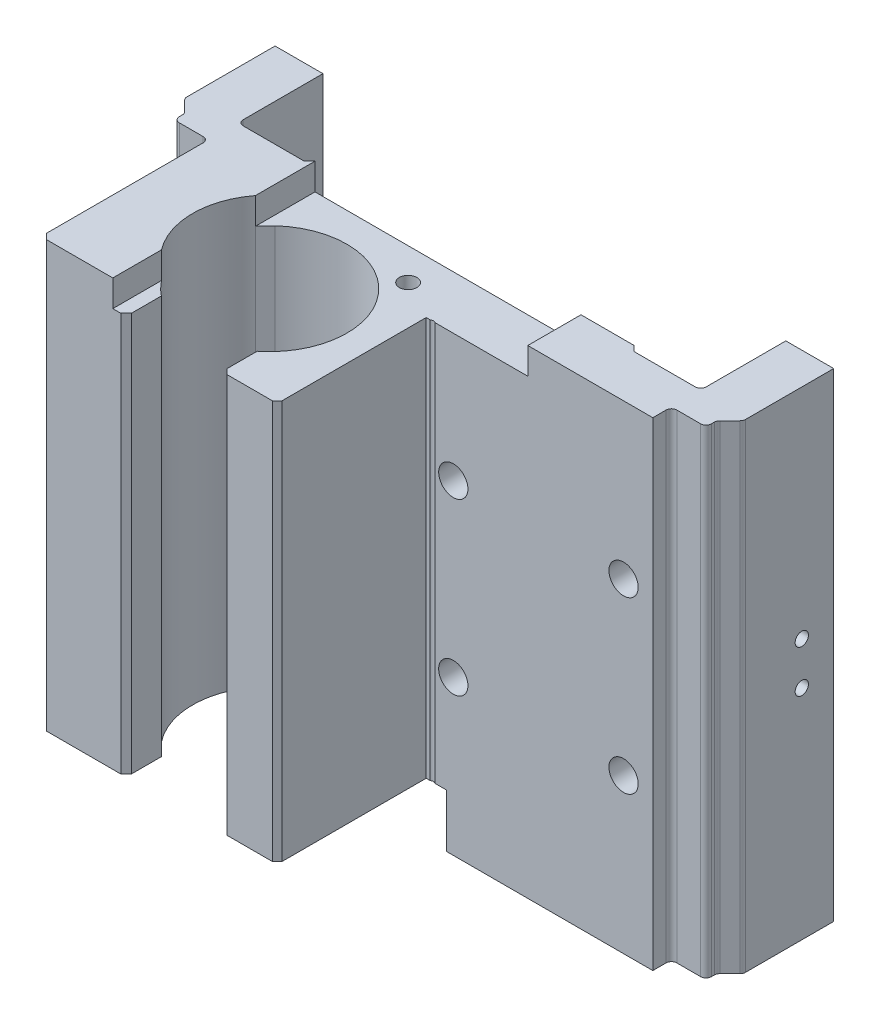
ISO-10303-21;
HEADER;
FILE_DESCRIPTION(('STEP AP214'),'2;1');
FILE_NAME('part.step','',(''),(''),'','','');
FILE_SCHEMA(('AUTOMOTIVE_DESIGN { 1 0 10303 214 1 1 1 1 }'));
ENDSEC;
DATA;
#1=APPLICATION_CONTEXT('core data for automotive mechanical design processes');
#2=APPLICATION_PROTOCOL_DEFINITION('international standard','automotive_design',2000,#1);
#3=PRODUCT_CONTEXT('',#1,'mechanical');
#4=PRODUCT('Part','Part','',(#3));
#5=PRODUCT_RELATED_PRODUCT_CATEGORY('part','',(#4));
#6=PRODUCT_DEFINITION_FORMATION('','',#4);
#7=PRODUCT_DEFINITION_CONTEXT('part definition',#1,'design');
#8=PRODUCT_DEFINITION('design','',#6,#7);
#9=PRODUCT_DEFINITION_SHAPE('','',#8);
#10=(LENGTH_UNIT() NAMED_UNIT(*) SI_UNIT(.MILLI.,.METRE.));
#11=(NAMED_UNIT(*) PLANE_ANGLE_UNIT() SI_UNIT($,.RADIAN.));
#12=(NAMED_UNIT(*) SI_UNIT($,.STERADIAN.) SOLID_ANGLE_UNIT());
#13=UNCERTAINTY_MEASURE_WITH_UNIT(LENGTH_MEASURE(1.E-05),#10,'distance_accuracy_value','');
#14=(GEOMETRIC_REPRESENTATION_CONTEXT(3) GLOBAL_UNCERTAINTY_ASSIGNED_CONTEXT((#13)) GLOBAL_UNIT_ASSIGNED_CONTEXT((#10,
#11,#12)) REPRESENTATION_CONTEXT('',''));
#15=CARTESIAN_POINT('',(0.,0.,0.));
#16=DIRECTION('',(0.,0.,1.));
#17=DIRECTION('',(1.,0.,0.));
#18=AXIS2_PLACEMENT_3D('',#15,#16,#17);
#19=CARTESIAN_POINT('',(59.5,0.,36.417387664));
#20=DIRECTION('',(-1.,0.,0.));
#21=DIRECTION('',(0.,0.,1.));
#22=AXIS2_PLACEMENT_3D('',#19,#20,#21);
#23=PLANE('',#22);
#24=DIRECTION('',(0.,1.,0.));
#25=VECTOR('',#24,1.);
#26=CARTESIAN_POINT('',(59.5,45.,36.4173876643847));
#27=LINE('',#26,#25);
#28=CARTESIAN_POINT('',(59.5,90.,36.4173876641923));
#29=VERTEX_POINT('',#28);
#30=CARTESIAN_POINT('',(59.5,0.,36.4173876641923));
#31=VERTEX_POINT('',#30);
#32=EDGE_CURVE('E466',#29,#31,#27,.F.);
#33=ORIENTED_EDGE('',*,*,#32,.F.);
#34=DIRECTION('',(0.,0.,-1.));
#35=VECTOR('',#34,1.);
#36=CARTESIAN_POINT('',(59.5,90.,36.7102808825));
#37=LINE('',#36,#35);
#38=CARTESIAN_POINT('',(59.5,90.,37.0031741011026));
#39=VERTEX_POINT('',#38);
#40=EDGE_CURVE('E464',#39,#29,#37,.T.);
#41=ORIENTED_EDGE('',*,*,#40,.F.);
#42=DIRECTION('',(0.,1.,0.));
#43=VECTOR('',#42,1.);
#44=CARTESIAN_POINT('',(59.5,45.,37.0031741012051));
#45=LINE('',#44,#43);
#46=CARTESIAN_POINT('',(59.5,0.,37.0031741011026));
#47=VERTEX_POINT('',#46);
#48=EDGE_CURVE('E281',#39,#47,#45,.F.);
#49=ORIENTED_EDGE('',*,*,#48,.T.);
#50=DIRECTION('',(0.,0.,1.));
#51=VECTOR('',#50,1.);
#52=CARTESIAN_POINT('',(59.5,0.,36.7102808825));
#53=LINE('',#52,#51);
#54=EDGE_CURVE('E285',#31,#47,#53,.T.);
#55=ORIENTED_EDGE('',*,*,#54,.F.);
#56=EDGE_LOOP('',(#33,#41,#49,#55));
#57=FACE_BOUND('',#56,.T.);
#58=ADVANCED_FACE('F17',(#57),#23,.F.);
#59=CARTESIAN_POINT('',(53.748924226,49.,22.503174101));
#60=DIRECTION('',(1.,0.,0.));
#61=DIRECTION('',(0.,1.,0.));
#62=AXIS2_PLACEMENT_3D('',#59,#60,#61);
#63=CONICAL_SURFACE('',#62,0.,1.02974425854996);
#64=CARTESIAN_POINT('',(53.748924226,49.,22.503174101));
#65=VERTEX_POINT('',#64);
#66=VERTEX_LOOP('',#65);
#67=FACE_BOUND('',#66,.T.);
#68=CARTESIAN_POINT('',(54.5,49.,22.503174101));
#69=DIRECTION('',(1.,0.,0.));
#70=DIRECTION('',(0.,0.,-1.));
#71=AXIS2_PLACEMENT_3D('',#68,#69,#70);
#72=CIRCLE('',#71,1.25);
#73=CARTESIAN_POINT('',(54.5,49.,21.253174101));
#74=VERTEX_POINT('',#73);
#75=EDGE_CURVE('E460',#74,#74,#72,.F.);
#76=ORIENTED_EDGE('',*,*,#75,.F.);
#77=EDGE_LOOP('',(#76));
#78=FACE_BOUND('',#77,.T.);
#79=ADVANCED_FACE('F715',(#67,#78),#63,.F.);
#80=CARTESIAN_POINT('',(53.748924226,41.,22.503174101));
#81=DIRECTION('',(1.,0.,0.));
#82=DIRECTION('',(0.,1.,0.));
#83=AXIS2_PLACEMENT_3D('',#80,#81,#82);
#84=CONICAL_SURFACE('',#83,0.,1.02974425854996);
#85=CARTESIAN_POINT('',(53.748924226,41.,22.503174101));
#86=VERTEX_POINT('',#85);
#87=VERTEX_LOOP('',#86);
#88=FACE_BOUND('',#87,.T.);
#89=CARTESIAN_POINT('',(54.5,41.,22.503174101));
#90=DIRECTION('',(1.,0.,0.));
#91=DIRECTION('',(0.,0.,-1.));
#92=AXIS2_PLACEMENT_3D('',#89,#90,#91);
#93=CIRCLE('',#92,1.25);
#94=CARTESIAN_POINT('',(54.5,41.,21.253174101));
#95=VERTEX_POINT('',#94);
#96=EDGE_CURVE('E457',#95,#95,#93,.F.);
#97=ORIENTED_EDGE('',*,*,#96,.F.);
#98=EDGE_LOOP('',(#97));
#99=FACE_BOUND('',#98,.T.);
#100=ADVANCED_FACE('F711',(#88,#99),#84,.F.);
#101=CARTESIAN_POINT('',(57.,82.,30.164981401));
#102=DIRECTION('',(0.,0.,-1.));
#103=DIRECTION('',(0.,1.,0.));
#104=AXIS2_PLACEMENT_3D('',#101,#102,#103);
#105=CONICAL_SURFACE('',#104,0.,1.02974425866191);
#106=CARTESIAN_POINT('',(57.,82.,30.164981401));
#107=VERTEX_POINT('',#106);
#108=VERTEX_LOOP('',#107);
#109=FACE_BOUND('',#108,.T.);
#110=CARTESIAN_POINT('',(57.,82.,28.903174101));
#111=DIRECTION('',(0.,0.,-1.));
#112=DIRECTION('',(-1.,0.,0.));
#113=AXIS2_PLACEMENT_3D('',#110,#111,#112);
#114=CIRCLE('',#113,2.1);
#115=CARTESIAN_POINT('',(54.9,82.,28.903174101));
#116=VERTEX_POINT('',#115);
#117=EDGE_CURVE('E454',#116,#116,#114,.F.);
#118=ORIENTED_EDGE('',*,*,#117,.F.);
#119=EDGE_LOOP('',(#118));
#120=FACE_BOUND('',#119,.T.);
#121=ADVANCED_FACE('F707',(#109,#120),#105,.F.);
#122=CARTESIAN_POINT('',(57.,8.,30.164981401));
#123=DIRECTION('',(0.,0.,-1.));
#124=DIRECTION('',(0.,1.,0.));
#125=AXIS2_PLACEMENT_3D('',#122,#123,#124);
#126=CONICAL_SURFACE('',#125,0.,1.02974425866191);
#127=CARTESIAN_POINT('',(57.,8.,30.164981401));
#128=VERTEX_POINT('',#127);
#129=VERTEX_LOOP('',#128);
#130=FACE_BOUND('',#129,.T.);
#131=CARTESIAN_POINT('',(57.,8.,28.903174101));
#132=DIRECTION('',(0.,0.,-1.));
#133=DIRECTION('',(-1.,0.,0.));
#134=AXIS2_PLACEMENT_3D('',#131,#132,#133);
#135=CIRCLE('',#134,2.1);
#136=CARTESIAN_POINT('',(54.9,8.,28.903174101));
#137=VERTEX_POINT('',#136);
#138=EDGE_CURVE('E450',#137,#137,#135,.F.);
#139=ORIENTED_EDGE('',*,*,#138,.F.);
#140=EDGE_LOOP('',(#139));
#141=FACE_BOUND('',#140,.T.);
#142=ADVANCED_FACE('F704',(#130,#141),#126,.F.);
#143=CARTESIAN_POINT('',(59.53,42.47,28.503174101));
#144=DIRECTION('',(0.,0.,-1.));
#145=DIRECTION('',(-1.,0.,0.));
#146=AXIS2_PLACEMENT_3D('',#143,#144,#145);
#147=PLANE('',#146);
#148=CARTESIAN_POINT('',(57.,45.,28.503174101));
#149=DIRECTION('',(0.,0.,-1.));
#150=DIRECTION('',(0.,1.,0.));
#151=AXIS2_PLACEMENT_3D('',#148,#149,#150);
#152=CIRCLE('',#151,2.5);
#153=CARTESIAN_POINT('',(57.,47.5,28.503174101));
#154=VERTEX_POINT('',#153);
#155=EDGE_CURVE('E453',#154,#154,#152,.F.);
#156=ORIENTED_EDGE('',*,*,#155,.F.);
#157=EDGE_LOOP('',(#156));
#158=FACE_BOUND('',#157,.T.);
#159=ADVANCED_FACE('F703',(#158),#147,.T.);
#160=CARTESIAN_POINT('',(58.5,90.,37.003174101));
#161=DIRECTION('',(0.,-1.,0.));
#162=DIRECTION('',(0.,0.,-1.));
#163=AXIS2_PLACEMENT_3D('',#160,#161,#162);
#164=CYLINDRICAL_SURFACE('',#163,1.);
#165=ORIENTED_EDGE('',*,*,#48,.F.);
#166=CARTESIAN_POINT('',(58.5,90.,37.003174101));
#167=DIRECTION('',(0.,-1.,0.));
#168=DIRECTION('',(0.,0.,-1.));
#169=AXIS2_PLACEMENT_3D('',#166,#167,#168);
#170=CIRCLE('',#169,1.);
#171=CARTESIAN_POINT('',(58.5,90.,38.003174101));
#172=VERTEX_POINT('',#171);
#173=EDGE_CURVE('E21',#172,#39,#170,.F.);
#174=ORIENTED_EDGE('',*,*,#173,.F.);
#175=DIRECTION('',(0.,-1.,0.));
#176=VECTOR('',#175,1.);
#177=CARTESIAN_POINT('',(58.5,45.,38.003174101));
#178=LINE('',#177,#176);
#179=CARTESIAN_POINT('',(58.5,0.,38.003174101));
#180=VERTEX_POINT('',#179);
#181=EDGE_CURVE('E278',#172,#180,#178,.T.);
#182=ORIENTED_EDGE('',*,*,#181,.T.);
#183=CARTESIAN_POINT('',(58.5,0.,37.003174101));
#184=DIRECTION('',(0.,-1.,0.));
#185=DIRECTION('',(0.,0.,-1.));
#186=AXIS2_PLACEMENT_3D('',#183,#184,#185);
#187=CIRCLE('',#186,1.);
#188=EDGE_CURVE('E472',#47,#180,#187,.T.);
#189=ORIENTED_EDGE('',*,*,#188,.F.);
#190=EDGE_LOOP('',(#165,#174,#182,#189));
#191=FACE_BOUND('',#190,.T.);
#192=ADVANCED_FACE('F276',(#191),#164,.T.);
#193=CARTESIAN_POINT('',(60.5,90.,36.417387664));
#194=DIRECTION('',(0.,-1.,0.));
#195=DIRECTION('',(0.,0.,-1.));
#196=AXIS2_PLACEMENT_3D('',#193,#194,#195);
#197=CYLINDRICAL_SURFACE('',#196,1.);
#198=CARTESIAN_POINT('',(60.5,90.,36.417387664));
#199=DIRECTION('',(0.,-1.,0.));
#200=DIRECTION('',(0.,0.,-1.));
#201=AXIS2_PLACEMENT_3D('',#198,#199,#200);
#202=CIRCLE('',#201,1.);
#203=CARTESIAN_POINT('',(59.7928932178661,90.,35.7102808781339));
#204=VERTEX_POINT('',#203);
#205=EDGE_CURVE('E470',#204,#29,#202,.F.);
#206=ORIENTED_EDGE('',*,*,#205,.T.);
#207=ORIENTED_EDGE('',*,*,#32,.T.);
#208=CARTESIAN_POINT('',(60.5,0.,36.417387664));
#209=DIRECTION('',(0.,-1.,0.));
#210=DIRECTION('',(0.,0.,-1.));
#211=AXIS2_PLACEMENT_3D('',#208,#209,#210);
#212=CIRCLE('',#211,1.);
#213=CARTESIAN_POINT('',(59.79289321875,0.,35.71028088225));
#214=VERTEX_POINT('',#213);
#215=EDGE_CURVE('E1223',#31,#214,#212,.T.);
#216=ORIENTED_EDGE('',*,*,#215,.T.);
#217=DIRECTION('',(0.,1.,0.));
#218=VECTOR('',#217,1.);
#219=CARTESIAN_POINT('',(59.792893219,45.,35.710280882));
#220=LINE('',#219,#218);
#221=EDGE_CURVE('E293',#214,#204,#220,.T.);
#222=ORIENTED_EDGE('',*,*,#221,.T.);
#223=EDGE_LOOP('',(#206,#207,#216,#222));
#224=FACE_BOUND('',#223,.T.);
#225=ADVANCED_FACE('F696',(#224),#197,.F.);
#226=CARTESIAN_POINT('',(61.,90.,33.088960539));
#227=DIRECTION('',(0.,-1.,0.));
#228=DIRECTION('',(0.,0.,-1.));
#229=AXIS2_PLACEMENT_3D('',#226,#227,#228);
#230=CYLINDRICAL_SURFACE('',#229,1.);
#231=DIRECTION('',(0.,1.,0.));
#232=VECTOR('',#231,1.);
#233=CARTESIAN_POINT('',(62.,45.,33.088960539));
#234=LINE('',#233,#232);
#235=CARTESIAN_POINT('',(62.,0.,33.088960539));
#236=VERTEX_POINT('',#235);
#237=CARTESIAN_POINT('',(62.,90.,33.088960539));
#238=VERTEX_POINT('',#237);
#239=EDGE_CURVE('E428',#236,#238,#234,.T.);
#240=ORIENTED_EDGE('',*,*,#239,.T.);
#241=CARTESIAN_POINT('',(61.,90.,33.088960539));
#242=DIRECTION('',(0.,-1.,0.));
#243=DIRECTION('',(0.,0.,-1.));
#244=AXIS2_PLACEMENT_3D('',#241,#242,#243);
#245=CIRCLE('',#244,1.);
#246=CARTESIAN_POINT('',(61.7071067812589,90.,33.7960673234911));
#247=VERTEX_POINT('',#246);
#248=EDGE_CURVE('E469',#247,#238,#245,.F.);
#249=ORIENTED_EDGE('',*,*,#248,.F.);
#250=DIRECTION('',(0.,-1.,0.));
#251=VECTOR('',#250,1.);
#252=CARTESIAN_POINT('',(61.707106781,45.,33.79606732));
#253=LINE('',#252,#251);
#254=CARTESIAN_POINT('',(61.707106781,0.,33.79606732));
#255=VERTEX_POINT('',#254);
#256=EDGE_CURVE('E432',#247,#255,#253,.T.);
#257=ORIENTED_EDGE('',*,*,#256,.T.);
#258=CARTESIAN_POINT('',(61.,0.,33.088960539));
#259=DIRECTION('',(0.,-1.,0.));
#260=DIRECTION('',(0.,0.,-1.));
#261=AXIS2_PLACEMENT_3D('',#258,#259,#260);
#262=CIRCLE('',#261,1.);
#263=EDGE_CURVE('E463',#236,#255,#262,.T.);
#264=ORIENTED_EDGE('',*,*,#263,.F.);
#265=EDGE_LOOP('',(#240,#249,#257,#264));
#266=FACE_BOUND('',#265,.T.);
#267=ADVANCED_FACE('F692',(#266),#230,.T.);
#268=CARTESIAN_POINT('',(54.5,49.,22.503174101));
#269=DIRECTION('',(1.,0.,0.));
#270=DIRECTION('',(0.,1.,0.));
#271=AXIS2_PLACEMENT_3D('',#268,#269,#270);
#272=CYLINDRICAL_SURFACE('',#271,1.25);
#273=ORIENTED_EDGE('',*,*,#75,.T.);
#274=EDGE_LOOP('',(#273));
#275=FACE_BOUND('',#274,.T.);
#276=CARTESIAN_POINT('',(62.,49.,22.503174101));
#277=DIRECTION('',(1.,0.,0.));
#278=DIRECTION('',(0.,1.,0.));
#279=AXIS2_PLACEMENT_3D('',#276,#277,#278);
#280=CIRCLE('',#279,1.25);
#281=CARTESIAN_POINT('',(62.,50.25,22.503174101));
#282=VERTEX_POINT('',#281);
#283=EDGE_CURVE('E431',#282,#282,#280,.T.);
#284=ORIENTED_EDGE('',*,*,#283,.T.);
#285=EDGE_LOOP('',(#284));
#286=FACE_BOUND('',#285,.T.);
#287=ADVANCED_FACE('F688',(#275,#286),#272,.F.);
#288=CARTESIAN_POINT('',(54.5,41.,22.503174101));
#289=DIRECTION('',(1.,0.,0.));
#290=DIRECTION('',(0.,1.,0.));
#291=AXIS2_PLACEMENT_3D('',#288,#289,#290);
#292=CYLINDRICAL_SURFACE('',#291,1.25);
#293=ORIENTED_EDGE('',*,*,#96,.T.);
#294=EDGE_LOOP('',(#293));
#295=FACE_BOUND('',#294,.T.);
#296=CARTESIAN_POINT('',(62.,41.,22.503174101));
#297=DIRECTION('',(1.,0.,0.));
#298=DIRECTION('',(0.,1.,0.));
#299=AXIS2_PLACEMENT_3D('',#296,#297,#298);
#300=CIRCLE('',#299,1.25);
#301=CARTESIAN_POINT('',(62.,42.25,22.503174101));
#302=VERTEX_POINT('',#301);
#303=EDGE_CURVE('E425',#302,#302,#300,.T.);
#304=ORIENTED_EDGE('',*,*,#303,.T.);
#305=EDGE_LOOP('',(#304));
#306=FACE_BOUND('',#305,.T.);
#307=ADVANCED_FACE('F684',(#295,#306),#292,.F.);
#308=CARTESIAN_POINT('',(57.,82.,28.903174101));
#309=DIRECTION('',(0.,0.,-1.));
#310=DIRECTION('',(0.,1.,0.));
#311=AXIS2_PLACEMENT_3D('',#308,#309,#310);
#312=CYLINDRICAL_SURFACE('',#311,2.1);
#313=ORIENTED_EDGE('',*,*,#117,.T.);
#314=EDGE_LOOP('',(#313));
#315=FACE_BOUND('',#314,.T.);
#316=CARTESIAN_POINT('',(57.,82.,16.503174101));
#317=DIRECTION('',(0.,0.,-1.));
#318=DIRECTION('',(0.,1.,0.));
#319=AXIS2_PLACEMENT_3D('',#316,#317,#318);
#320=CIRCLE('',#319,2.1);
#321=CARTESIAN_POINT('',(57.,84.1,16.503174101));
#322=VERTEX_POINT('',#321);
#323=EDGE_CURVE('E424',#322,#322,#320,.T.);
#324=ORIENTED_EDGE('',*,*,#323,.T.);
#325=EDGE_LOOP('',(#324));
#326=FACE_BOUND('',#325,.T.);
#327=ADVANCED_FACE('F680',(#315,#326),#312,.F.);
#328=CARTESIAN_POINT('',(57.,8.,28.903174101));
#329=DIRECTION('',(0.,0.,-1.));
#330=DIRECTION('',(0.,1.,0.));
#331=AXIS2_PLACEMENT_3D('',#328,#329,#330);
#332=CYLINDRICAL_SURFACE('',#331,2.1);
#333=ORIENTED_EDGE('',*,*,#138,.T.);
#334=EDGE_LOOP('',(#333));
#335=FACE_BOUND('',#334,.T.);
#336=CARTESIAN_POINT('',(57.,7.99999999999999,16.503174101));
#337=DIRECTION('',(0.,0.,-1.));
#338=DIRECTION('',(0.,1.,0.));
#339=AXIS2_PLACEMENT_3D('',#336,#337,#338);
#340=CIRCLE('',#339,2.1);
#341=CARTESIAN_POINT('',(57.,10.1,16.503174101));
#342=VERTEX_POINT('',#341);
#343=EDGE_CURVE('E639',#342,#342,#340,.T.);
#344=ORIENTED_EDGE('',*,*,#343,.T.);
#345=EDGE_LOOP('',(#344));
#346=FACE_BOUND('',#345,.T.);
#347=ADVANCED_FACE('F676',(#335,#346),#332,.F.);
#348=CARTESIAN_POINT('',(57.,45.,28.503174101));
#349=DIRECTION('',(0.,0.,-1.));
#350=DIRECTION('',(0.,1.,0.));
#351=AXIS2_PLACEMENT_3D('',#348,#349,#350);
#352=CYLINDRICAL_SURFACE('',#351,2.5);
#353=ORIENTED_EDGE('',*,*,#155,.T.);
#354=EDGE_LOOP('',(#353));
#355=FACE_BOUND('',#354,.T.);
#356=CARTESIAN_POINT('',(57.,45.,16.503174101));
#357=DIRECTION('',(0.,0.,-1.));
#358=DIRECTION('',(0.,1.,0.));
#359=AXIS2_PLACEMENT_3D('',#356,#357,#358);
#360=CIRCLE('',#359,2.5);
#361=CARTESIAN_POINT('',(57.,47.5,16.503174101));
#362=VERTEX_POINT('',#361);
#363=EDGE_CURVE('E411',#362,#362,#360,.T.);
#364=ORIENTED_EDGE('',*,*,#363,.T.);
#365=EDGE_LOOP('',(#364));
#366=FACE_BOUND('',#365,.T.);
#367=ADVANCED_FACE('F670',(#355,#366),#352,.F.);
#368=CARTESIAN_POINT('',(52.,90.,31.503174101));
#369=DIRECTION('',(0.,-1.,0.));
#370=DIRECTION('',(0.,0.,-1.));
#371=AXIS2_PLACEMENT_3D('',#368,#369,#370);
#372=CYLINDRICAL_SURFACE('',#371,0.999999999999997);
#373=DIRECTION('',(0.,1.,0.));
#374=VECTOR('',#373,1.);
#375=CARTESIAN_POINT('',(52.,45.,32.503174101));
#376=LINE('',#375,#374);
#377=CARTESIAN_POINT('',(52.,0.,32.503174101));
#378=VERTEX_POINT('',#377);
#379=CARTESIAN_POINT('',(52.0000000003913,26.8205505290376,32.5031741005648));
#380=VERTEX_POINT('',#379);
#381=EDGE_CURVE('E402',#378,#380,#376,.T.);
#382=ORIENTED_EDGE('',*,*,#381,.T.);
#383=CARTESIAN_POINT('',(52.0000000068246,31.1794494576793,32.503174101));
#384=CARTESIAN_POINT('',(52.0278051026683,31.1220410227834,32.5031658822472));
#385=CARTESIAN_POINT('',(52.0545004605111,31.0641196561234,32.5020155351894));
#386=CARTESIAN_POINT('',(52.1056262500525,30.9473736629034,32.497912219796));
#387=CARTESIAN_POINT('',(52.130057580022,30.8885494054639,32.4949599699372));
#388=CARTESIAN_POINT('',(52.1998940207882,30.7109011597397,32.4841245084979));
#389=CARTESIAN_POINT('',(52.241871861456,30.5908391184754,32.474261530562));
#390=CARTESIAN_POINT('',(52.3164884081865,30.3481656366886,32.4525641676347));
#391=CARTESIAN_POINT('',(52.3491344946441,30.2255562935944,32.4407313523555));
#392=CARTESIAN_POINT('',(52.4050252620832,29.9781604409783,32.4179783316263));
#393=CARTESIAN_POINT('',(52.4282731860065,29.8533746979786,32.4070578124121));
#394=CARTESIAN_POINT('',(52.4644492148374,29.6074719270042,32.3889962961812));
#395=CARTESIAN_POINT('',(52.4777736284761,29.486424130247,32.3817144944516));
#396=CARTESIAN_POINT('',(52.4955451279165,29.2435847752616,32.3718173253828));
#397=CARTESIAN_POINT('',(52.5000002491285,29.1217939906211,32.3691977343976));
#398=CARTESIAN_POINT('',(52.4999997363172,28.8710906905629,32.3692013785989));
#399=CARTESIAN_POINT('',(52.4950083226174,28.7421777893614,32.3721398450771));
#400=CARTESIAN_POINT('',(52.4751064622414,28.485286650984,32.3831729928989));
#401=CARTESIAN_POINT('',(52.4601901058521,28.3573090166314,32.3912707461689));
#402=CARTESIAN_POINT('',(52.4205513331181,28.1029024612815,32.4107095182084));
#403=CARTESIAN_POINT('',(52.39581044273,27.976476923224,32.4220566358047));
#404=CARTESIAN_POINT('',(52.3366717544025,27.7259612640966,32.4453315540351));
#405=CARTESIAN_POINT('',(52.3022735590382,27.6018712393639,32.4572593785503));
#406=CARTESIAN_POINT('',(52.2271272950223,27.3665233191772,32.4777530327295));
#407=CARTESIAN_POINT('',(52.1871281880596,27.2550456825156,32.4865139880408));
#408=CARTESIAN_POINT('',(52.1212635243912,27.0901802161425,32.4960408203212));
#409=CARTESIAN_POINT('',(52.0983712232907,27.0357000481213,32.4986127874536));
#410=CARTESIAN_POINT('',(52.050638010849,26.9275153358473,32.502176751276));
#411=CARTESIAN_POINT('',(52.0257960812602,26.8738112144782,32.5031679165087));
#412=CARTESIAN_POINT('',(52.0000000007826,26.8205505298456,32.503174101));
#413=B_SPLINE_CURVE_WITH_KNOTS('',3,(#383,#384,#385,#386,#387,#388,#389,#390,#391,#392,#393,
#394,#395,#396,#397,#398,#399,#400,#401,#402,#403,#404,#405,#406,#407,#408,#409,#410,#411,#412),
.UNSPECIFIED.,.F.,.F.,(4,2,2,2,2,2,2,2,2,2,2,2,2,2,4),(0.,0.191305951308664,0.382535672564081,
0.764787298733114,1.14673576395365,1.52855232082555,1.89415503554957,2.25942637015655,
2.64603718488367,3.03287840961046,3.42045052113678,3.80803858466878,4.1639421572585,
4.34134138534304,4.51883388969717),.UNSPECIFIED.);
#414=CARTESIAN_POINT('',(52.0000000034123,31.1794494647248,32.5031741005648));
#415=VERTEX_POINT('',#414);
#416=EDGE_CURVE('E649',#415,#380,#413,.T.);
#417=ORIENTED_EDGE('',*,*,#416,.F.);
#418=DIRECTION('',(0.,1.,0.));
#419=VECTOR('',#418,1.);
#420=CARTESIAN_POINT('',(52.,45.,32.503174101));
#421=LINE('',#420,#419);
#422=CARTESIAN_POINT('',(52.0000000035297,58.8205505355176,32.5031741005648));
#423=VERTEX_POINT('',#422);
#424=EDGE_CURVE('E398',#415,#423,#421,.T.);
#425=ORIENTED_EDGE('',*,*,#424,.T.);
#426=CARTESIAN_POINT('',(52.0000000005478,63.1794494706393,32.503174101));
#427=CARTESIAN_POINT('',(52.0278050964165,63.1220410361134,32.5031658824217));
#428=CARTESIAN_POINT('',(52.0545004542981,63.0641196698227,32.5020155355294));
#429=CARTESIAN_POINT('',(52.1056262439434,62.9473736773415,32.4979122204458));
#430=CARTESIAN_POINT('',(52.1300575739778,62.8885494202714,32.4949599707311));
#431=CARTESIAN_POINT('',(52.1998940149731,62.7109011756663,32.4841245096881));
#432=CARTESIAN_POINT('',(52.2418718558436,62.5908391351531,32.474261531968));
#433=CARTESIAN_POINT('',(52.3164884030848,62.3481656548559,32.4525641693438));
#434=CARTESIAN_POINT('',(52.3491344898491,62.2255563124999,32.4407313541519));
#435=CARTESIAN_POINT('',(52.4050252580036,61.9781604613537,32.4179783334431));
#436=CARTESIAN_POINT('',(52.4282731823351,61.8533747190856,32.407057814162));
#437=CARTESIAN_POINT('',(52.4644492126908,61.6074719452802,32.388996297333));
#438=CARTESIAN_POINT('',(52.4777736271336,61.4864241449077,32.3817144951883));
#439=CARTESIAN_POINT('',(52.4955451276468,61.2435847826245,32.3718173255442));
#440=CARTESIAN_POINT('',(52.5000002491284,61.1217939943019,32.3691977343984));
#441=CARTESIAN_POINT('',(52.4999997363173,60.8710906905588,32.369201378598));
#442=CARTESIAN_POINT('',(52.4950083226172,60.7421777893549,32.372139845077));
#443=CARTESIAN_POINT('',(52.4751064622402,60.4852866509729,32.3831729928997));
#444=CARTESIAN_POINT('',(52.4601901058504,60.3573090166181,32.3912707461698));
#445=CARTESIAN_POINT('',(52.4205513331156,60.1029024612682,32.4107095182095));
#446=CARTESIAN_POINT('',(52.3958104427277,59.9764769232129,32.4220566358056));
#447=CARTESIAN_POINT('',(52.3366717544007,59.7259612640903,32.4453315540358));
#448=CARTESIAN_POINT('',(52.3022735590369,59.60187123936,32.4572593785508));
#449=CARTESIAN_POINT('',(52.2271272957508,59.3665233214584,32.4777530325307));
#450=CARTESIAN_POINT('',(52.18712818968,59.2550456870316,32.4865139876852));
#451=CARTESIAN_POINT('',(52.1212635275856,59.0901802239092,32.4960408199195));
#452=CARTESIAN_POINT('',(52.098371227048,59.0357000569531,32.4986127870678));
#453=CARTESIAN_POINT('',(52.0506380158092,58.9275153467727,32.5021767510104));
#454=CARTESIAN_POINT('',(52.0257960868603,58.8738112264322,32.5031679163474));
#455=CARTESIAN_POINT('',(52.0000000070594,58.8205505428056,32.503174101));
#456=B_SPLINE_CURVE_WITH_KNOTS('',3,(#426,#427,#428,#429,#430,#431,#432,#433,#434,#435,#436,
#437,#438,#439,#440,#441,#442,#443,#444,#445,#446,#447,#448,#449,#450,#451,#452,#453,#454,#455),
.UNSPECIFIED.,.F.,.F.,(4,2,2,2,2,2,2,2,2,2,2,2,2,2,4),(0.,0.19130595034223,0.382535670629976,
0.764787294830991,1.14673575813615,1.52855231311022,1.89415503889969,2.2594263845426,
2.64603719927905,3.03287842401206,3.42045053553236,3.80803859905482,4.16394216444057,
4.34134138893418,4.51883388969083),.UNSPECIFIED.);
#457=CARTESIAN_POINT('',(52.0000000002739,63.1794494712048,32.5031741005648));
#458=VERTEX_POINT('',#457);
#459=EDGE_CURVE('E656',#458,#423,#456,.T.);
#460=ORIENTED_EDGE('',*,*,#459,.F.);
#461=DIRECTION('',(0.,1.,0.));
#462=VECTOR('',#461,1.);
#463=CARTESIAN_POINT('',(52.,45.,32.503174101));
#464=LINE('',#463,#462);
#465=CARTESIAN_POINT('',(52.,90.,32.503174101));
#466=VERTEX_POINT('',#465);
#467=EDGE_CURVE('E393',#458,#466,#464,.T.);
#468=ORIENTED_EDGE('',*,*,#467,.T.);
#469=CARTESIAN_POINT('',(52.,90.,31.503174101));
#470=DIRECTION('',(0.,-1.,0.));
#471=DIRECTION('',(0.,0.,-1.));
#472=AXIS2_PLACEMENT_3D('',#469,#470,#471);
#473=CIRCLE('',#472,0.999999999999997);
#474=CARTESIAN_POINT('',(52.99999999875,90.,31.503174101));
#475=VERTEX_POINT('',#474);
#476=EDGE_CURVE('E1097',#466,#475,#473,.F.);
#477=ORIENTED_EDGE('',*,*,#476,.T.);
#478=DIRECTION('',(0.,-1.,0.));
#479=VECTOR('',#478,1.);
#480=CARTESIAN_POINT('',(53.,45.,31.503174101));
#481=LINE('',#480,#479);
#482=CARTESIAN_POINT('',(53.0000000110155,0.,31.503174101));
#483=VERTEX_POINT('',#482);
#484=EDGE_CURVE('E405',#475,#483,#481,.T.);
#485=ORIENTED_EDGE('',*,*,#484,.T.);
#486=CARTESIAN_POINT('',(52.,0.,31.503174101));
#487=DIRECTION('',(0.,-1.,0.));
#488=DIRECTION('',(0.,0.,-1.));
#489=AXIS2_PLACEMENT_3D('',#486,#487,#488);
#490=CIRCLE('',#489,0.999999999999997);
#491=EDGE_CURVE('E1099',#483,#378,#490,.T.);
#492=ORIENTED_EDGE('',*,*,#491,.T.);
#493=EDGE_LOOP('',(#382,#417,#425,#460,#468,#477,#485,#492));
#494=FACE_BOUND('',#493,.T.);
#495=ADVANCED_FACE('F665',(#494),#372,.F.);
#496=CARTESIAN_POINT('',(47.5,61.,37.203174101));
#497=DIRECTION('',(0.,0.,-1.));
#498=DIRECTION('',(-1.,0.,0.));
#499=AXIS2_PLACEMENT_3D('',#496,#497,#498);
#500=CYLINDRICAL_SURFACE('',#499,5.);
#501=CARTESIAN_POINT('',(47.5,61.,37.203174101));
#502=DIRECTION('',(0.,0.,-1.));
#503=DIRECTION('',(-1.,0.,0.));
#504=AXIS2_PLACEMENT_3D('',#501,#502,#503);
#505=CIRCLE('',#504,5.);
#506=CARTESIAN_POINT('',(42.5,61.,37.203174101));
#507=VERTEX_POINT('',#506);
#508=EDGE_CURVE('E396',#507,#507,#505,.F.);
#509=ORIENTED_EDGE('',*,*,#508,.T.);
#510=EDGE_LOOP('',(#509));
#511=FACE_BOUND('',#510,.T.);
#512=CARTESIAN_POINT('',(47.5,61.,32.5031741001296));
#513=DIRECTION('',(0.,0.,-1.));
#514=DIRECTION('',(-1.,0.,0.));
#515=AXIS2_PLACEMENT_3D('',#512,#513,#514);
#516=CIRCLE('',#515,5.);
#517=EDGE_CURVE('E397',#423,#458,#516,.T.);
#518=ORIENTED_EDGE('',*,*,#517,.T.);
#519=ORIENTED_EDGE('',*,*,#459,.T.);
#520=EDGE_LOOP('',(#518,#519));
#521=FACE_BOUND('',#520,.T.);
#522=ADVANCED_FACE('F669',(#511,#521),#500,.F.);
#523=CARTESIAN_POINT('',(47.5,29.,37.203174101));
#524=DIRECTION('',(0.,0.,-1.));
#525=DIRECTION('',(-1.,0.,0.));
#526=AXIS2_PLACEMENT_3D('',#523,#524,#525);
#527=CYLINDRICAL_SURFACE('',#526,5.);
#528=CARTESIAN_POINT('',(47.5,29.,37.203174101));
#529=DIRECTION('',(0.,0.,-1.));
#530=DIRECTION('',(-1.,0.,0.));
#531=AXIS2_PLACEMENT_3D('',#528,#529,#530);
#532=CIRCLE('',#531,5.);
#533=CARTESIAN_POINT('',(42.5,29.,37.203174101));
#534=VERTEX_POINT('',#533);
#535=EDGE_CURVE('E392',#534,#534,#532,.F.);
#536=ORIENTED_EDGE('',*,*,#535,.T.);
#537=EDGE_LOOP('',(#536));
#538=FACE_BOUND('',#537,.T.);
#539=CARTESIAN_POINT('',(47.5,29.,32.5031741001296));
#540=DIRECTION('',(0.,0.,-1.));
#541=DIRECTION('',(-1.,0.,0.));
#542=AXIS2_PLACEMENT_3D('',#539,#540,#541);
#543=CIRCLE('',#542,5.);
#544=EDGE_CURVE('E401',#380,#415,#543,.T.);
#545=ORIENTED_EDGE('',*,*,#544,.T.);
#546=ORIENTED_EDGE('',*,*,#416,.T.);
#547=EDGE_LOOP('',(#545,#546));
#548=FACE_BOUND('',#547,.T.);
#549=ADVANCED_FACE('F662',(#538,#548),#527,.F.);
#550=CARTESIAN_POINT('',(54.,90.,39.003174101));
#551=DIRECTION('',(0.,-1.,0.));
#552=DIRECTION('',(0.,0.,-1.));
#553=AXIS2_PLACEMENT_3D('',#550,#551,#552);
#554=CYLINDRICAL_SURFACE('',#553,1.);
#555=CARTESIAN_POINT('',(54.,90.,39.003174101));
#556=DIRECTION('',(0.,-1.,0.));
#557=DIRECTION('',(0.,0.,-1.));
#558=AXIS2_PLACEMENT_3D('',#555,#556,#557);
#559=CIRCLE('',#558,1.);
#560=CARTESIAN_POINT('',(53.,90.,39.003174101));
#561=VERTEX_POINT('',#560);
#562=CARTESIAN_POINT('',(54.,90.,38.003174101));
#563=VERTEX_POINT('',#562);
#564=EDGE_CURVE('E298',#561,#563,#559,.T.);
#565=ORIENTED_EDGE('',*,*,#564,.F.);
#566=DIRECTION('',(0.,-1.,0.));
#567=VECTOR('',#566,1.);
#568=CARTESIAN_POINT('',(53.,45.,39.003174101));
#569=LINE('',#568,#567);
#570=CARTESIAN_POINT('',(53.0000000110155,0.,39.003174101));
#571=VERTEX_POINT('',#570);
#572=EDGE_CURVE('E439',#561,#571,#569,.T.);
#573=ORIENTED_EDGE('',*,*,#572,.T.);
#574=CARTESIAN_POINT('',(54.,0.,39.003174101));
#575=DIRECTION('',(0.,-1.,0.));
#576=DIRECTION('',(0.,0.,-1.));
#577=AXIS2_PLACEMENT_3D('',#574,#575,#576);
#578=CIRCLE('',#577,1.);
#579=CARTESIAN_POINT('',(54.,0.,38.003174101));
#580=VERTEX_POINT('',#579);
#581=EDGE_CURVE('E437',#571,#580,#578,.T.);
#582=ORIENTED_EDGE('',*,*,#581,.T.);
#583=DIRECTION('',(0.,1.,0.));
#584=VECTOR('',#583,1.);
#585=CARTESIAN_POINT('',(54.,45.,38.003174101));
#586=LINE('',#585,#584);
#587=EDGE_CURVE('E294',#580,#563,#586,.T.);
#588=ORIENTED_EDGE('',*,*,#587,.T.);
#589=EDGE_LOOP('',(#565,#573,#582,#588));
#590=FACE_BOUND('',#589,.T.);
#591=ADVANCED_FACE('F729',(#590),#554,.F.);
#592=CARTESIAN_POINT('',(58.5,0.,38.003174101));
#593=DIRECTION('',(0.,0.,-1.));
#594=DIRECTION('',(-1.,0.,0.));
#595=AXIS2_PLACEMENT_3D('',#592,#593,#594);
#596=PLANE('',#595);
#597=ORIENTED_EDGE('',*,*,#181,.F.);
#598=DIRECTION('',(1.,0.,0.));
#599=VECTOR('',#598,1.);
#600=CARTESIAN_POINT('',(45.75,90.,38.003174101));
#601=LINE('',#600,#599);
#602=EDGE_CURVE('E290',#563,#172,#601,.T.);
#603=ORIENTED_EDGE('',*,*,#602,.F.);
#604=ORIENTED_EDGE('',*,*,#587,.F.);
#605=DIRECTION('',(1.,0.,0.));
#606=VECTOR('',#605,1.);
#607=CARTESIAN_POINT('',(38.1337578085,0.,38.003174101));
#608=LINE('',#607,#606);
#609=EDGE_CURVE('E292',#580,#180,#608,.T.);
#610=ORIENTED_EDGE('',*,*,#609,.T.);
#611=EDGE_LOOP('',(#597,#603,#604,#610));
#612=FACE_BOUND('',#611,.T.);
#613=ADVANCED_FACE('F288',(#612),#596,.F.);
#614=CARTESIAN_POINT('',(61.707106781,0.,33.79606732));
#615=DIRECTION('',(-0.707106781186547,0.,-0.707106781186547));
#616=DIRECTION('',(-0.707106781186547,0.,0.707106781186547));
#617=AXIS2_PLACEMENT_3D('',#614,#615,#616);
#618=PLANE('',#617);
#619=ORIENTED_EDGE('',*,*,#256,.F.);
#620=DIRECTION('',(0.707106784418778,0.,-0.707106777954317));
#621=VECTOR('',#620,1.);
#622=CARTESIAN_POINT('',(59.792893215,90.,35.710280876));
#623=LINE('',#622,#621);
#624=EDGE_CURVE('E300',#204,#247,#623,.T.);
#625=ORIENTED_EDGE('',*,*,#624,.F.);
#626=ORIENTED_EDGE('',*,*,#221,.F.);
#627=DIRECTION('',(-0.707106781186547,0.,0.707106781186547));
#628=VECTOR('',#627,1.);
#629=CARTESIAN_POINT('',(61.707106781,0.,33.79606732));
#630=LINE('',#629,#628);
#631=EDGE_CURVE('E615',#214,#255,#630,.F.);
#632=ORIENTED_EDGE('',*,*,#631,.T.);
#633=EDGE_LOOP('',(#619,#625,#626,#632));
#634=FACE_BOUND('',#633,.T.);
#635=ADVANCED_FACE('F728',(#634),#618,.F.);
#636=CARTESIAN_POINT('',(62.,0.,16.503174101));
#637=DIRECTION('',(-1.,0.,0.));
#638=DIRECTION('',(0.,0.,1.));
#639=AXIS2_PLACEMENT_3D('',#636,#637,#638);
#640=PLANE('',#639);
#641=ORIENTED_EDGE('',*,*,#303,.F.);
#642=EDGE_LOOP('',(#641));
#643=FACE_BOUND('',#642,.T.);
#644=ORIENTED_EDGE('',*,*,#283,.F.);
#645=EDGE_LOOP('',(#644));
#646=FACE_BOUND('',#645,.T.);
#647=DIRECTION('',(0.,1.,0.));
#648=VECTOR('',#647,1.);
#649=CARTESIAN_POINT('',(62.,45.,16.503174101));
#650=LINE('',#649,#648);
#651=CARTESIAN_POINT('',(62.,0.,16.503174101));
#652=VERTEX_POINT('',#651);
#653=CARTESIAN_POINT('',(62.,90.,16.503174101));
#654=VERTEX_POINT('',#653);
#655=EDGE_CURVE('E421',#652,#654,#650,.T.);
#656=ORIENTED_EDGE('',*,*,#655,.T.);
#657=DIRECTION('',(0.,0.,-1.));
#658=VECTOR('',#657,1.);
#659=CARTESIAN_POINT('',(62.,90.,29.003174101));
#660=LINE('',#659,#658);
#661=EDGE_CURVE('E303',#238,#654,#660,.T.);
#662=ORIENTED_EDGE('',*,*,#661,.F.);
#663=ORIENTED_EDGE('',*,*,#239,.F.);
#664=DIRECTION('',(0.,0.,-1.));
#665=VECTOR('',#664,1.);
#666=CARTESIAN_POINT('',(62.,0.,29.003174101));
#667=LINE('',#666,#665);
#668=EDGE_CURVE('E418',#236,#652,#667,.T.);
#669=ORIENTED_EDGE('',*,*,#668,.T.);
#670=EDGE_LOOP('',(#656,#662,#663,#669));
#671=FACE_BOUND('',#670,.T.);
#672=ADVANCED_FACE('F732',(#643,#646,#671),#640,.F.);
#673=CARTESIAN_POINT('',(53.,0.,16.503174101));
#674=DIRECTION('',(0.,0.,1.));
#675=DIRECTION('',(1.,0.,0.));
#676=AXIS2_PLACEMENT_3D('',#673,#674,#675);
#677=PLANE('',#676);
#678=ORIENTED_EDGE('',*,*,#363,.F.);
#679=EDGE_LOOP('',(#678));
#680=FACE_BOUND('',#679,.T.);
#681=ORIENTED_EDGE('',*,*,#343,.F.);
#682=EDGE_LOOP('',(#681));
#683=FACE_BOUND('',#682,.T.);
#684=ORIENTED_EDGE('',*,*,#323,.F.);
#685=EDGE_LOOP('',(#684));
#686=FACE_BOUND('',#685,.T.);
#687=DIRECTION('',(0.,1.,0.));
#688=VECTOR('',#687,1.);
#689=CARTESIAN_POINT('',(53.,45.,16.503174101));
#690=LINE('',#689,#688);
#691=CARTESIAN_POINT('',(53.0000000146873,0.,16.503174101));
#692=VERTEX_POINT('',#691);
#693=CARTESIAN_POINT('',(52.99999999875,90.,16.503174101));
#694=VERTEX_POINT('',#693);
#695=EDGE_CURVE('E408',#692,#694,#690,.T.);
#696=ORIENTED_EDGE('',*,*,#695,.T.);
#697=DIRECTION('',(-1.,0.,0.));
#698=VECTOR('',#697,1.);
#699=CARTESIAN_POINT('',(45.75,90.,16.503174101));
#700=LINE('',#699,#698);
#701=EDGE_CURVE('E444',#654,#694,#700,.T.);
#702=ORIENTED_EDGE('',*,*,#701,.F.);
#703=ORIENTED_EDGE('',*,*,#655,.F.);
#704=DIRECTION('',(-1.,0.,0.));
#705=VECTOR('',#704,1.);
#706=CARTESIAN_POINT('',(38.1337578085,0.,16.503174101));
#707=LINE('',#706,#705);
#708=EDGE_CURVE('E414',#652,#692,#707,.T.);
#709=ORIENTED_EDGE('',*,*,#708,.T.);
#710=EDGE_LOOP('',(#696,#702,#703,#709));
#711=FACE_BOUND('',#710,.T.);
#712=ADVANCED_FACE('F736',(#680,#683,#686,#711),#677,.F.);
#713=CARTESIAN_POINT('',(53.,0.,31.503174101));
#714=DIRECTION('',(1.,0.,0.));
#715=DIRECTION('',(0.,0.,-1.));
#716=AXIS2_PLACEMENT_3D('',#713,#714,#715);
#717=PLANE('',#716);
#718=ORIENTED_EDGE('',*,*,#484,.F.);
#719=DIRECTION('',(0.,0.,1.));
#720=VECTOR('',#719,1.);
#721=CARTESIAN_POINT('',(52.9999999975,90.,29.003174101));
#722=LINE('',#721,#720);
#723=EDGE_CURVE('E447',#694,#475,#722,.T.);
#724=ORIENTED_EDGE('',*,*,#723,.F.);
#725=ORIENTED_EDGE('',*,*,#695,.F.);
#726=DIRECTION('',(0.,0.,1.));
#727=VECTOR('',#726,1.);
#728=CARTESIAN_POINT('',(53.000000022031,0.,29.003174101));
#729=LINE('',#728,#727);
#730=EDGE_CURVE('E417',#692,#483,#729,.T.);
#731=ORIENTED_EDGE('',*,*,#730,.T.);
#732=EDGE_LOOP('',(#718,#724,#725,#731));
#733=FACE_BOUND('',#732,.T.);
#734=ADVANCED_FACE('F740',(#733),#717,.F.);
#735=CARTESIAN_POINT('',(40.5,0.,32.503174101));
#736=DIRECTION('',(0.,0.,1.));
#737=DIRECTION('',(1.,0.,0.));
#738=AXIS2_PLACEMENT_3D('',#735,#736,#737);
#739=PLANE('',#738);
#740=ORIENTED_EDGE('',*,*,#517,.F.);
#741=ORIENTED_EDGE('',*,*,#424,.F.);
#742=ORIENTED_EDGE('',*,*,#544,.F.);
#743=ORIENTED_EDGE('',*,*,#381,.F.);
#744=DIRECTION('',(-1.,0.,0.));
#745=VECTOR('',#744,1.);
#746=CARTESIAN_POINT('',(38.1337578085,0.,32.503174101));
#747=LINE('',#746,#745);
#748=CARTESIAN_POINT('',(40.5,0.,32.503174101));
#749=VERTEX_POINT('',#748);
#750=EDGE_CURVE('E614',#378,#749,#747,.T.);
#751=ORIENTED_EDGE('',*,*,#750,.T.);
#752=DIRECTION('',(0.,1.,0.));
#753=VECTOR('',#752,1.);
#754=CARTESIAN_POINT('',(40.5,45.,32.503174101));
#755=LINE('',#754,#753);
#756=CARTESIAN_POINT('',(40.4999999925,90.,32.503174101));
#757=VERTEX_POINT('',#756);
#758=EDGE_CURVE('E388',#749,#757,#755,.T.);
#759=ORIENTED_EDGE('',*,*,#758,.T.);
#760=DIRECTION('',(-1.,0.,0.));
#761=VECTOR('',#760,1.);
#762=CARTESIAN_POINT('',(45.75,90.,32.503174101));
#763=LINE('',#762,#761);
#764=EDGE_CURVE('E619',#466,#757,#763,.T.);
#765=ORIENTED_EDGE('',*,*,#764,.F.);
#766=ORIENTED_EDGE('',*,*,#467,.F.);
#767=EDGE_LOOP('',(#740,#741,#742,#743,#751,#759,#765,#766));
#768=FACE_BOUND('',#767,.T.);
#769=ADVANCED_FACE('F744',(#768),#739,.F.);
#770=CARTESIAN_POINT('',(42.44,55.94,37.203174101));
#771=DIRECTION('',(0.,0.,1.));
#772=DIRECTION('',(1.,0.,0.));
#773=AXIS2_PLACEMENT_3D('',#770,#771,#772);
#774=PLANE('',#773);
#775=CARTESIAN_POINT('',(47.5,61.,37.203174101));
#776=DIRECTION('',(0.,0.,-1.));
#777=DIRECTION('',(0.,1.,0.));
#778=AXIS2_PLACEMENT_3D('',#775,#776,#777);
#779=CIRCLE('',#778,2.75);
#780=CARTESIAN_POINT('',(47.5,63.75,37.203174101));
#781=VERTEX_POINT('',#780);
#782=EDGE_CURVE('E608',#781,#781,#779,.T.);
#783=ORIENTED_EDGE('',*,*,#782,.F.);
#784=EDGE_LOOP('',(#783));
#785=FACE_BOUND('',#784,.T.);
#786=ORIENTED_EDGE('',*,*,#508,.F.);
#787=EDGE_LOOP('',(#786));
#788=FACE_BOUND('',#787,.T.);
#789=ADVANCED_FACE('F748',(#785,#788),#774,.F.);
#790=CARTESIAN_POINT('',(42.44,23.94,37.203174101));
#791=DIRECTION('',(0.,0.,1.));
#792=DIRECTION('',(1.,0.,0.));
#793=AXIS2_PLACEMENT_3D('',#790,#791,#792);
#794=PLANE('',#793);
#795=CARTESIAN_POINT('',(47.5,29.,37.203174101));
#796=DIRECTION('',(0.,0.,-1.));
#797=DIRECTION('',(0.,1.,0.));
#798=AXIS2_PLACEMENT_3D('',#795,#796,#797);
#799=CIRCLE('',#798,2.75);
#800=CARTESIAN_POINT('',(47.5,31.75,37.203174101));
#801=VERTEX_POINT('',#800);
#802=EDGE_CURVE('E605',#801,#801,#799,.T.);
#803=ORIENTED_EDGE('',*,*,#802,.F.);
#804=EDGE_LOOP('',(#803));
#805=FACE_BOUND('',#804,.T.);
#806=ORIENTED_EDGE('',*,*,#535,.F.);
#807=EDGE_LOOP('',(#806));
#808=FACE_BOUND('',#807,.T.);
#809=ADVANCED_FACE('F752',(#805,#808),#794,.F.);
#810=CARTESIAN_POINT('',(10.44,23.94,37.203174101));
#811=DIRECTION('',(0.,0.,1.));
#812=DIRECTION('',(1.,0.,0.));
#813=AXIS2_PLACEMENT_3D('',#810,#811,#812);
#814=PLANE('',#813);
#815=CARTESIAN_POINT('',(15.5,29.,37.203174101));
#816=DIRECTION('',(0.,0.,-1.));
#817=DIRECTION('',(0.,1.,0.));
#818=AXIS2_PLACEMENT_3D('',#815,#816,#817);
#819=CIRCLE('',#818,2.75);
#820=CARTESIAN_POINT('',(15.5,31.75,37.203174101));
#821=VERTEX_POINT('',#820);
#822=EDGE_CURVE('E602',#821,#821,#819,.T.);
#823=ORIENTED_EDGE('',*,*,#822,.F.);
#824=EDGE_LOOP('',(#823));
#825=FACE_BOUND('',#824,.T.);
#826=CARTESIAN_POINT('',(15.5,29.,37.203174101));
#827=DIRECTION('',(0.,0.,-1.));
#828=DIRECTION('',(-1.,0.,0.));
#829=AXIS2_PLACEMENT_3D('',#826,#827,#828);
#830=CIRCLE('',#829,5.);
#831=CARTESIAN_POINT('',(10.5,29.,37.203174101));
#832=VERTEX_POINT('',#831);
#833=EDGE_CURVE('E391',#832,#832,#830,.F.);
#834=ORIENTED_EDGE('',*,*,#833,.F.);
#835=EDGE_LOOP('',(#834));
#836=FACE_BOUND('',#835,.T.);
#837=ADVANCED_FACE('F756',(#825,#836),#814,.F.);
#838=CARTESIAN_POINT('',(10.44,55.94,37.203174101));
#839=DIRECTION('',(0.,0.,1.));
#840=DIRECTION('',(1.,0.,0.));
#841=AXIS2_PLACEMENT_3D('',#838,#839,#840);
#842=PLANE('',#841);
#843=CARTESIAN_POINT('',(15.5,61.,37.203174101));
#844=DIRECTION('',(0.,0.,-1.));
#845=DIRECTION('',(0.,1.,0.));
#846=AXIS2_PLACEMENT_3D('',#843,#844,#845);
#847=CIRCLE('',#846,2.75);
#848=CARTESIAN_POINT('',(15.5,63.75,37.203174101));
#849=VERTEX_POINT('',#848);
#850=EDGE_CURVE('E380',#849,#849,#847,.T.);
#851=ORIENTED_EDGE('',*,*,#850,.F.);
#852=EDGE_LOOP('',(#851));
#853=FACE_BOUND('',#852,.T.);
#854=CARTESIAN_POINT('',(15.5,61.,37.203174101));
#855=DIRECTION('',(0.,0.,-1.));
#856=DIRECTION('',(-1.,0.,0.));
#857=AXIS2_PLACEMENT_3D('',#854,#855,#856);
#858=CIRCLE('',#857,5.);
#859=CARTESIAN_POINT('',(10.5,61.,37.203174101));
#860=VERTEX_POINT('',#859);
#861=EDGE_CURVE('E624',#860,#860,#858,.F.);
#862=ORIENTED_EDGE('',*,*,#861,.F.);
#863=EDGE_LOOP('',(#862));
#864=FACE_BOUND('',#863,.T.);
#865=ADVANCED_FACE('F760',(#853,#864),#842,.F.);
#866=CARTESIAN_POINT('',(3.,73.908579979,37.503174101));
#867=DIRECTION('',(0.,1.,0.));
#868=DIRECTION('',(0.,0.,1.));
#869=AXIS2_PLACEMENT_3D('',#866,#867,#868);
#870=CONICAL_SURFACE('',#869,0.,1.02974425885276);
#871=CARTESIAN_POINT('',(3.,73.908579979,37.503174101));
#872=VERTEX_POINT('',#871);
#873=VERTEX_LOOP('',#872);
#874=FACE_BOUND('',#873,.T.);
#875=CARTESIAN_POINT('',(3.,74.9,37.503174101));
#876=DIRECTION('',(0.,1.,0.));
#877=DIRECTION('',(0.,0.,1.));
#878=AXIS2_PLACEMENT_3D('',#875,#876,#877);
#879=CIRCLE('',#878,1.65);
#880=CARTESIAN_POINT('',(3.,74.9,39.153174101));
#881=VERTEX_POINT('',#880);
#882=EDGE_CURVE('E314',#881,#881,#879,.F.);
#883=ORIENTED_EDGE('',*,*,#882,.F.);
#884=EDGE_LOOP('',(#883));
#885=FACE_BOUND('',#884,.T.);
#886=ADVANCED_FACE('F764',(#874,#885),#870,.F.);
#887=CARTESIAN_POINT('',(39.5,0.,31.503174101));
#888=DIRECTION('',(-0.707106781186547,0.,0.707106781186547));
#889=DIRECTION('',(0.707106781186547,0.,0.707106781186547));
#890=AXIS2_PLACEMENT_3D('',#887,#888,#889);
#891=PLANE('',#890);
#892=DIRECTION('',(0.,1.,0.));
#893=VECTOR('',#892,1.);
#894=CARTESIAN_POINT('',(39.5,45.,31.503174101));
#895=LINE('',#894,#893);
#896=CARTESIAN_POINT('',(39.5,0.,31.503174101));
#897=VERTEX_POINT('',#896);
#898=CARTESIAN_POINT('',(39.500000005,90.,31.503174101));
#899=VERTEX_POINT('',#898);
#900=EDGE_CURVE('E325',#897,#899,#895,.T.);
#901=ORIENTED_EDGE('',*,*,#900,.T.);
#902=DIRECTION('',(-0.707106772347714,0.,-0.707106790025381));
#903=VECTOR('',#902,1.);
#904=CARTESIAN_POINT('',(40.499999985,90.,32.503174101));
#905=LINE('',#904,#903);
#906=EDGE_CURVE('E618',#757,#899,#905,.T.);
#907=ORIENTED_EDGE('',*,*,#906,.F.);
#908=ORIENTED_EDGE('',*,*,#758,.F.);
#909=DIRECTION('',(0.707106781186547,0.,0.707106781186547));
#910=VECTOR('',#909,1.);
#911=CARTESIAN_POINT('',(39.5,0.,31.503174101));
#912=LINE('',#911,#910);
#913=EDGE_CURVE('E611',#749,#897,#912,.F.);
#914=ORIENTED_EDGE('',*,*,#913,.T.);
#915=EDGE_LOOP('',(#901,#907,#908,#914));
#916=FACE_BOUND('',#915,.T.);
#917=ADVANCED_FACE('F766',(#916),#891,.F.);
#918=CARTESIAN_POINT('',(15.5,29.,37.203174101));
#919=DIRECTION('',(0.,0.,-1.));
#920=DIRECTION('',(-1.,0.,0.));
#921=AXIS2_PLACEMENT_3D('',#918,#919,#920);
#922=CYLINDRICAL_SURFACE('',#921,5.);
#923=ORIENTED_EDGE('',*,*,#833,.T.);
#924=EDGE_LOOP('',(#923));
#925=FACE_BOUND('',#924,.T.);
#926=CARTESIAN_POINT('',(15.5,29.,31.503174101));
#927=DIRECTION('',(0.,0.,-1.));
#928=DIRECTION('',(-1.,0.,0.));
#929=AXIS2_PLACEMENT_3D('',#926,#927,#928);
#930=CIRCLE('',#929,5.);
#931=CARTESIAN_POINT('',(10.5,29.,31.503174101));
#932=VERTEX_POINT('',#931);
#933=EDGE_CURVE('E321',#932,#932,#930,.T.);
#934=ORIENTED_EDGE('',*,*,#933,.T.);
#935=EDGE_LOOP('',(#934));
#936=FACE_BOUND('',#935,.T.);
#937=ADVANCED_FACE('F769',(#925,#936),#922,.F.);
#938=CARTESIAN_POINT('',(15.5,61.,37.203174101));
#939=DIRECTION('',(0.,0.,-1.));
#940=DIRECTION('',(-1.,0.,0.));
#941=AXIS2_PLACEMENT_3D('',#938,#939,#940);
#942=CYLINDRICAL_SURFACE('',#941,5.);
#943=ORIENTED_EDGE('',*,*,#861,.T.);
#944=EDGE_LOOP('',(#943));
#945=FACE_BOUND('',#944,.T.);
#946=CARTESIAN_POINT('',(15.5,61.,31.503174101));
#947=DIRECTION('',(0.,0.,-1.));
#948=DIRECTION('',(-1.,0.,0.));
#949=AXIS2_PLACEMENT_3D('',#946,#947,#948);
#950=CIRCLE('',#949,5.);
#951=CARTESIAN_POINT('',(10.5,61.,31.503174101));
#952=VERTEX_POINT('',#951);
#953=EDGE_CURVE('E594',#952,#952,#950,.T.);
#954=ORIENTED_EDGE('',*,*,#953,.T.);
#955=EDGE_LOOP('',(#954));
#956=FACE_BOUND('',#955,.T.);
#957=ADVANCED_FACE('F1038',(#945,#956),#942,.F.);
#958=CARTESIAN_POINT('',(11.6,85.,42.103174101));
#959=DIRECTION('',(0.,-1.,0.));
#960=DIRECTION('',(0.,0.,-1.));
#961=AXIS2_PLACEMENT_3D('',#958,#959,#960);
#962=CYLINDRICAL_SURFACE('',#961,0.750000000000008);
#963=CARTESIAN_POINT('',(11.6,9.99999999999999,42.103174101));
#964=DIRECTION('',(0.,-1.,0.));
#965=DIRECTION('',(0.,0.,-1.));
#966=AXIS2_PLACEMENT_3D('',#963,#964,#965);
#967=CIRCLE('',#966,0.750000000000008);
#968=CARTESIAN_POINT('',(11.15,10.,41.503174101));
#969=VERTEX_POINT('',#968);
#970=CARTESIAN_POINT('',(12.0500000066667,9.99999999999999,41.503174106));
#971=VERTEX_POINT('',#970);
#972=EDGE_CURVE('E305',#969,#971,#967,.T.);
#973=ORIENTED_EDGE('',*,*,#972,.T.);
#974=DIRECTION('',(0.,1.,0.));
#975=VECTOR('',#974,1.);
#976=CARTESIAN_POINT('',(12.05,45.,41.503174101));
#977=LINE('',#976,#975);
#978=CARTESIAN_POINT('',(12.0500000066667,85.,41.503174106));
#979=VERTEX_POINT('',#978);
#980=EDGE_CURVE('E1874',#971,#979,#977,.T.);
#981=ORIENTED_EDGE('',*,*,#980,.T.);
#982=CARTESIAN_POINT('',(11.6,85.,42.103174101));
#983=DIRECTION('',(0.,-1.,0.));
#984=DIRECTION('',(0.,0.,-1.));
#985=AXIS2_PLACEMENT_3D('',#982,#983,#984);
#986=CIRCLE('',#985,0.750000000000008);
#987=CARTESIAN_POINT('',(11.15,85.,41.503174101));
#988=VERTEX_POINT('',#987);
#989=EDGE_CURVE('E622',#979,#988,#986,.F.);
#990=ORIENTED_EDGE('',*,*,#989,.T.);
#991=DIRECTION('',(0.,-1.,0.));
#992=VECTOR('',#991,1.);
#993=CARTESIAN_POINT('',(11.15,47.5,41.503174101));
#994=LINE('',#993,#992);
#995=EDGE_CURVE('E358',#988,#969,#994,.T.);
#996=ORIENTED_EDGE('',*,*,#995,.T.);
#997=EDGE_LOOP('',(#973,#981,#990,#996));
#998=FACE_BOUND('',#997,.T.);
#999=ADVANCED_FACE('F774',(#998),#962,.F.);
#1000=CARTESIAN_POINT('',(29.5,90.,16.503174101));
#1001=DIRECTION('',(0.,1.,0.));
#1002=DIRECTION('',(0.,0.,1.));
#1003=AXIS2_PLACEMENT_3D('',#1000,#1001,#1002);
#1004=PLANE('',#1003);
#1005=ORIENTED_EDGE('',*,*,#906,.T.);
#1006=DIRECTION('',(-1.,0.,0.));
#1007=VECTOR('',#1006,1.);
#1008=CARTESIAN_POINT('',(9.5,90.,31.503174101));
#1009=LINE('',#1008,#1007);
#1010=CARTESIAN_POINT('',(29.49999999,90.,31.503174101));
#1011=VERTEX_POINT('',#1010);
#1012=EDGE_CURVE('E328',#899,#1011,#1009,.T.);
#1013=ORIENTED_EDGE('',*,*,#1012,.T.);
#1014=DIRECTION('',(0.,0.,1.));
#1015=VECTOR('',#1014,1.);
#1016=CARTESIAN_POINT('',(29.5,90.,36.503174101));
#1017=LINE('',#1016,#1015);
#1018=CARTESIAN_POINT('',(29.4999999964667,90.,41.503174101));
#1019=VERTEX_POINT('',#1018);
#1020=EDGE_CURVE('E311',#1011,#1019,#1017,.T.);
#1021=ORIENTED_EDGE('',*,*,#1020,.T.);
#1022=DIRECTION('',(1.,0.,0.));
#1023=VECTOR('',#1022,1.);
#1024=CARTESIAN_POINT('',(32.525,90.,41.503174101));
#1025=LINE('',#1024,#1023);
#1026=CARTESIAN_POINT('',(53.,90.,41.503174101));
#1027=VERTEX_POINT('',#1026);
#1028=EDGE_CURVE('E1063',#1019,#1027,#1025,.T.);
#1029=ORIENTED_EDGE('',*,*,#1028,.T.);
#1030=DIRECTION('',(0.,0.,-1.));
#1031=VECTOR('',#1030,1.);
#1032=CARTESIAN_POINT('',(53.,90.,40.253174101));
#1033=LINE('',#1032,#1031);
#1034=EDGE_CURVE('E443',#1027,#561,#1033,.T.);
#1035=ORIENTED_EDGE('',*,*,#1034,.T.);
#1036=ORIENTED_EDGE('',*,*,#564,.T.);
#1037=ORIENTED_EDGE('',*,*,#602,.T.);
#1038=ORIENTED_EDGE('',*,*,#173,.T.);
#1039=ORIENTED_EDGE('',*,*,#40,.T.);
#1040=ORIENTED_EDGE('',*,*,#205,.F.);
#1041=ORIENTED_EDGE('',*,*,#624,.T.);
#1042=ORIENTED_EDGE('',*,*,#248,.T.);
#1043=ORIENTED_EDGE('',*,*,#661,.T.);
#1044=ORIENTED_EDGE('',*,*,#701,.T.);
#1045=ORIENTED_EDGE('',*,*,#723,.T.);
#1046=ORIENTED_EDGE('',*,*,#476,.F.);
#1047=ORIENTED_EDGE('',*,*,#764,.T.);
#1048=EDGE_LOOP('',(#1005,#1013,#1021,#1029,#1035,#1036,#1037,#1038,#1039,#1040,#1041,#1042,
#1043,#1044,#1045,#1046,#1047));
#1049=FACE_BOUND('',#1048,.T.);
#1050=ADVANCED_FACE('F296',(#1049),#1004,.T.);
#1051=CARTESIAN_POINT('',(53.,0.,39.003174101));
#1052=DIRECTION('',(-1.,0.,0.));
#1053=DIRECTION('',(0.,0.,1.));
#1054=AXIS2_PLACEMENT_3D('',#1051,#1052,#1053);
#1055=PLANE('',#1054);
#1056=ORIENTED_EDGE('',*,*,#572,.F.);
#1057=ORIENTED_EDGE('',*,*,#1034,.F.);
#1058=DIRECTION('',(0.,-1.,0.));
#1059=VECTOR('',#1058,1.);
#1060=CARTESIAN_POINT('',(53.,45.,41.503174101));
#1061=LINE('',#1060,#1059);
#1062=CARTESIAN_POINT('',(53.0000000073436,0.,41.503174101));
#1063=VERTEX_POINT('',#1062);
#1064=EDGE_CURVE('E1072',#1027,#1063,#1061,.T.);
#1065=ORIENTED_EDGE('',*,*,#1064,.T.);
#1066=DIRECTION('',(0.,0.,-1.));
#1067=VECTOR('',#1066,1.);
#1068=CARTESIAN_POINT('',(53.000000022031,0.,29.003174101));
#1069=LINE('',#1068,#1067);
#1070=EDGE_CURVE('E442',#1063,#571,#1069,.T.);
#1071=ORIENTED_EDGE('',*,*,#1070,.T.);
#1072=EDGE_LOOP('',(#1056,#1057,#1065,#1071));
#1073=FACE_BOUND('',#1072,.T.);
#1074=ADVANCED_FACE('F773',(#1073),#1055,.F.);
#1075=CARTESIAN_POINT('',(14.267515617,0.,16.503174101));
#1076=DIRECTION('',(0.,1.,0.));
#1077=DIRECTION('',(0.,0.,1.));
#1078=AXIS2_PLACEMENT_3D('',#1075,#1076,#1077);
#1079=PLANE('',#1078);
#1080=DIRECTION('',(0.,0.,-1.));
#1081=VECTOR('',#1080,1.);
#1082=CARTESIAN_POINT('',(14.267515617,0.,36.503174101));
#1083=LINE('',#1082,#1081);
#1084=CARTESIAN_POINT('',(14.2675156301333,0.,41.503174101));
#1085=VERTEX_POINT('',#1084);
#1086=CARTESIAN_POINT('',(14.267515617,0.,31.503174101));
#1087=VERTEX_POINT('',#1086);
#1088=EDGE_CURVE('E597',#1085,#1087,#1083,.T.);
#1089=ORIENTED_EDGE('',*,*,#1088,.T.);
#1090=DIRECTION('',(1.,0.,0.));
#1091=VECTOR('',#1090,1.);
#1092=CARTESIAN_POINT('',(9.5,0.,31.503174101));
#1093=LINE('',#1092,#1091);
#1094=EDGE_CURVE('E318',#1087,#897,#1093,.T.);
#1095=ORIENTED_EDGE('',*,*,#1094,.T.);
#1096=ORIENTED_EDGE('',*,*,#913,.F.);
#1097=ORIENTED_EDGE('',*,*,#750,.F.);
#1098=ORIENTED_EDGE('',*,*,#491,.F.);
#1099=ORIENTED_EDGE('',*,*,#730,.F.);
#1100=ORIENTED_EDGE('',*,*,#708,.F.);
#1101=ORIENTED_EDGE('',*,*,#668,.F.);
#1102=ORIENTED_EDGE('',*,*,#263,.T.);
#1103=ORIENTED_EDGE('',*,*,#631,.F.);
#1104=ORIENTED_EDGE('',*,*,#215,.F.);
#1105=ORIENTED_EDGE('',*,*,#54,.T.);
#1106=ORIENTED_EDGE('',*,*,#188,.T.);
#1107=ORIENTED_EDGE('',*,*,#609,.F.);
#1108=ORIENTED_EDGE('',*,*,#581,.F.);
#1109=ORIENTED_EDGE('',*,*,#1070,.F.);
#1110=DIRECTION('',(-1.,0.,0.));
#1111=VECTOR('',#1110,1.);
#1112=CARTESIAN_POINT('',(32.525,0.,41.503174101));
#1113=LINE('',#1112,#1111);
#1114=EDGE_CURVE('E1166',#1063,#1085,#1113,.T.);
#1115=ORIENTED_EDGE('',*,*,#1114,.T.);
#1116=EDGE_LOOP('',(#1089,#1095,#1096,#1097,#1098,#1099,#1100,#1101,#1102,#1103,#1104,#1105,
#1106,#1107,#1108,#1109,#1115));
#1117=FACE_BOUND('',#1116,.T.);
#1118=ADVANCED_FACE('F777',(#1117),#1079,.F.);
#1119=CARTESIAN_POINT('',(47.5,61.,41.503174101));
#1120=DIRECTION('',(0.,0.,-1.));
#1121=DIRECTION('',(0.,1.,0.));
#1122=AXIS2_PLACEMENT_3D('',#1119,#1120,#1121);
#1123=CYLINDRICAL_SURFACE('',#1122,2.75);
#1124=CARTESIAN_POINT('',(47.5,61.,41.503174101));
#1125=DIRECTION('',(0.,0.,-1.));
#1126=DIRECTION('',(0.,1.,0.));
#1127=AXIS2_PLACEMENT_3D('',#1124,#1125,#1126);
#1128=CIRCLE('',#1127,2.75);
#1129=CARTESIAN_POINT('',(47.5,63.75,41.503174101));
#1130=VERTEX_POINT('',#1129);
#1131=EDGE_CURVE('E590',#1130,#1130,#1128,.F.);
#1132=ORIENTED_EDGE('',*,*,#1131,.T.);
#1133=EDGE_LOOP('',(#1132));
#1134=FACE_BOUND('',#1133,.T.);
#1135=ORIENTED_EDGE('',*,*,#782,.T.);
#1136=EDGE_LOOP('',(#1135));
#1137=FACE_BOUND('',#1136,.T.);
#1138=ADVANCED_FACE('F781',(#1134,#1137),#1123,.F.);
#1139=CARTESIAN_POINT('',(47.5,29.,41.503174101));
#1140=DIRECTION('',(0.,0.,-1.));
#1141=DIRECTION('',(0.,1.,0.));
#1142=AXIS2_PLACEMENT_3D('',#1139,#1140,#1141);
#1143=CYLINDRICAL_SURFACE('',#1142,2.75);
#1144=CARTESIAN_POINT('',(47.5,29.,41.503174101));
#1145=DIRECTION('',(0.,0.,-1.));
#1146=DIRECTION('',(0.,1.,0.));
#1147=AXIS2_PLACEMENT_3D('',#1144,#1145,#1146);
#1148=CIRCLE('',#1147,2.75);
#1149=CARTESIAN_POINT('',(47.5,31.75,41.503174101));
#1150=VERTEX_POINT('',#1149);
#1151=EDGE_CURVE('E587',#1150,#1150,#1148,.F.);
#1152=ORIENTED_EDGE('',*,*,#1151,.T.);
#1153=EDGE_LOOP('',(#1152));
#1154=FACE_BOUND('',#1153,.T.);
#1155=ORIENTED_EDGE('',*,*,#802,.T.);
#1156=EDGE_LOOP('',(#1155));
#1157=FACE_BOUND('',#1156,.T.);
#1158=ADVANCED_FACE('F1028',(#1154,#1157),#1143,.F.);
#1159=CARTESIAN_POINT('',(15.5,29.,41.503174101));
#1160=DIRECTION('',(0.,0.,-1.));
#1161=DIRECTION('',(0.,1.,0.));
#1162=AXIS2_PLACEMENT_3D('',#1159,#1160,#1161);
#1163=CYLINDRICAL_SURFACE('',#1162,2.75);
#1164=CARTESIAN_POINT('',(15.5,29.,41.503174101));
#1165=DIRECTION('',(0.,0.,-1.));
#1166=DIRECTION('',(0.,1.,0.));
#1167=AXIS2_PLACEMENT_3D('',#1164,#1165,#1166);
#1168=CIRCLE('',#1167,2.75);
#1169=CARTESIAN_POINT('',(15.5,31.75,41.503174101));
#1170=VERTEX_POINT('',#1169);
#1171=EDGE_CURVE('E584',#1170,#1170,#1168,.F.);
#1172=ORIENTED_EDGE('',*,*,#1171,.T.);
#1173=EDGE_LOOP('',(#1172));
#1174=FACE_BOUND('',#1173,.T.);
#1175=ORIENTED_EDGE('',*,*,#822,.T.);
#1176=EDGE_LOOP('',(#1175));
#1177=FACE_BOUND('',#1176,.T.);
#1178=ADVANCED_FACE('F1024',(#1174,#1177),#1163,.F.);
#1179=CARTESIAN_POINT('',(15.5,61.,41.503174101));
#1180=DIRECTION('',(0.,0.,-1.));
#1181=DIRECTION('',(0.,1.,0.));
#1182=AXIS2_PLACEMENT_3D('',#1179,#1180,#1181);
#1183=CYLINDRICAL_SURFACE('',#1182,2.75);
#1184=CARTESIAN_POINT('',(15.5,61.,41.503174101));
#1185=DIRECTION('',(0.,0.,-1.));
#1186=DIRECTION('',(0.,1.,0.));
#1187=AXIS2_PLACEMENT_3D('',#1184,#1185,#1186);
#1188=CIRCLE('',#1187,2.75);
#1189=CARTESIAN_POINT('',(15.5,63.75,41.503174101));
#1190=VERTEX_POINT('',#1189);
#1191=EDGE_CURVE('E581',#1190,#1190,#1188,.F.);
#1192=ORIENTED_EDGE('',*,*,#1191,.T.);
#1193=EDGE_LOOP('',(#1192));
#1194=FACE_BOUND('',#1193,.T.);
#1195=ORIENTED_EDGE('',*,*,#850,.T.);
#1196=EDGE_LOOP('',(#1195));
#1197=FACE_BOUND('',#1196,.T.);
#1198=ADVANCED_FACE('F787',(#1194,#1197),#1183,.F.);
#1199=CARTESIAN_POINT('',(11.15,10.,41.503174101));
#1200=DIRECTION('',(0.,0.,-1.));
#1201=DIRECTION('',(-1.,0.,0.));
#1202=AXIS2_PLACEMENT_3D('',#1199,#1200,#1201);
#1203=PLANE('',#1202);
#1204=ORIENTED_EDGE('',*,*,#995,.F.);
#1205=DIRECTION('',(1.,0.,0.));
#1206=VECTOR('',#1205,1.);
#1207=CARTESIAN_POINT('',(10.775,85.,41.503174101));
#1208=LINE('',#1207,#1206);
#1209=CARTESIAN_POINT('',(10.4,85.,41.503174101));
#1210=VERTEX_POINT('',#1209);
#1211=EDGE_CURVE('E362',#1210,#988,#1208,.T.);
#1212=ORIENTED_EDGE('',*,*,#1211,.F.);
#1213=DIRECTION('',(0.,-1.,0.));
#1214=VECTOR('',#1213,1.);
#1215=CARTESIAN_POINT('',(10.4,47.5,41.503174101));
#1216=LINE('',#1215,#1214);
#1217=CARTESIAN_POINT('',(10.399999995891,10.,41.503174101));
#1218=VERTEX_POINT('',#1217);
#1219=EDGE_CURVE('E341',#1210,#1218,#1216,.T.);
#1220=ORIENTED_EDGE('',*,*,#1219,.T.);
#1221=DIRECTION('',(-1.,0.,0.));
#1222=VECTOR('',#1221,1.);
#1223=CARTESIAN_POINT('',(10.775,10.,41.503174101));
#1224=LINE('',#1223,#1222);
#1225=EDGE_CURVE('E361',#969,#1218,#1224,.T.);
#1226=ORIENTED_EDGE('',*,*,#1225,.F.);
#1227=EDGE_LOOP('',(#1204,#1212,#1220,#1226));
#1228=FACE_BOUND('',#1227,.T.);
#1229=ADVANCED_FACE('F783',(#1228),#1203,.F.);
#1230=CARTESIAN_POINT('',(10.4,10.,68.603174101));
#1231=DIRECTION('',(-0.707106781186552,0.,-0.707106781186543));
#1232=DIRECTION('',(-0.707106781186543,0.,0.707106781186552));
#1233=AXIS2_PLACEMENT_3D('',#1230,#1231,#1232);
#1234=PLANE('',#1233);
#1235=DIRECTION('',(0.,1.,0.));
#1236=VECTOR('',#1235,1.);
#1237=CARTESIAN_POINT('',(10.4,47.5,68.603174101));
#1238=LINE('',#1237,#1236);
#1239=CARTESIAN_POINT('',(10.399999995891,10.,68.6031740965));
#1240=VERTEX_POINT('',#1239);
#1241=CARTESIAN_POINT('',(10.4,85.,68.6031740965));
#1242=VERTEX_POINT('',#1241);
#1243=EDGE_CURVE('E370',#1240,#1242,#1238,.T.);
#1244=ORIENTED_EDGE('',*,*,#1243,.T.);
#1245=DIRECTION('',(0.707106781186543,0.,-0.707106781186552));
#1246=VECTOR('',#1245,1.);
#1247=CARTESIAN_POINT('',(9.95,85.,69.053174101));
#1248=LINE('',#1247,#1246);
#1249=CARTESIAN_POINT('',(9.5,85.,69.503174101));
#1250=VERTEX_POINT('',#1249);
#1251=EDGE_CURVE('E365',#1250,#1242,#1248,.T.);
#1252=ORIENTED_EDGE('',*,*,#1251,.F.);
#1253=DIRECTION('',(0.,-1.,0.));
#1254=VECTOR('',#1253,1.);
#1255=CARTESIAN_POINT('',(9.5,47.5,69.503174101));
#1256=LINE('',#1255,#1254);
#1257=CARTESIAN_POINT('',(9.49999999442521,10.,69.503174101));
#1258=VERTEX_POINT('',#1257);
#1259=EDGE_CURVE('E340',#1250,#1258,#1256,.T.);
#1260=ORIENTED_EDGE('',*,*,#1259,.T.);
#1261=DIRECTION('',(-0.707106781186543,0.,0.707106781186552));
#1262=VECTOR('',#1261,1.);
#1263=CARTESIAN_POINT('',(9.95,10.,69.053174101));
#1264=LINE('',#1263,#1262);
#1265=EDGE_CURVE('E1150',#1240,#1258,#1264,.T.);
#1266=ORIENTED_EDGE('',*,*,#1265,.F.);
#1267=EDGE_LOOP('',(#1244,#1252,#1260,#1266));
#1268=FACE_BOUND('',#1267,.T.);
#1269=ADVANCED_FACE('F786',(#1268),#1234,.F.);
#1270=CARTESIAN_POINT('',(1.,10.,69.503174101));
#1271=DIRECTION('',(0.707106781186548,0.,-0.707106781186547));
#1272=DIRECTION('',(-0.707106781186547,0.,-0.707106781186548));
#1273=AXIS2_PLACEMENT_3D('',#1270,#1271,#1272);
#1274=PLANE('',#1273);
#1275=DIRECTION('',(0.,1.,0.));
#1276=VECTOR('',#1275,1.);
#1277=CARTESIAN_POINT('',(1.,47.5,69.503174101));
#1278=LINE('',#1277,#1276);
#1279=CARTESIAN_POINT('',(1.,10.,69.503174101));
#1280=VERTEX_POINT('',#1279);
#1281=CARTESIAN_POINT('',(1.,85.,69.503174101));
#1282=VERTEX_POINT('',#1281);
#1283=EDGE_CURVE('E337',#1280,#1282,#1278,.T.);
#1284=ORIENTED_EDGE('',*,*,#1283,.T.);
#1285=DIRECTION('',(0.707106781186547,0.,0.707106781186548));
#1286=VECTOR('',#1285,1.);
#1287=CARTESIAN_POINT('',(0.5,85.,69.003174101));
#1288=LINE('',#1287,#1286);
#1289=CARTESIAN_POINT('',(0.,85.,68.503174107));
#1290=VERTEX_POINT('',#1289);
#1291=EDGE_CURVE('E1147',#1290,#1282,#1288,.T.);
#1292=ORIENTED_EDGE('',*,*,#1291,.F.);
#1293=DIRECTION('',(0.,-1.,0.));
#1294=VECTOR('',#1293,1.);
#1295=CARTESIAN_POINT('',(0.,47.5,68.503174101));
#1296=LINE('',#1295,#1294);
#1297=CARTESIAN_POINT('',(2.32730906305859E-09,10.,68.503174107));
#1298=VERTEX_POINT('',#1297);
#1299=EDGE_CURVE('E1920',#1290,#1298,#1296,.T.);
#1300=ORIENTED_EDGE('',*,*,#1299,.T.);
#1301=DIRECTION('',(-0.707106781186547,0.,-0.707106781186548));
#1302=VECTOR('',#1301,1.);
#1303=CARTESIAN_POINT('',(0.5,10.,69.003174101));
#1304=LINE('',#1303,#1302);
#1305=EDGE_CURVE('E315',#1280,#1298,#1304,.T.);
#1306=ORIENTED_EDGE('',*,*,#1305,.F.);
#1307=EDGE_LOOP('',(#1284,#1292,#1300,#1306));
#1308=FACE_BOUND('',#1307,.T.);
#1309=ADVANCED_FACE('F791',(#1308),#1274,.F.);
#1310=CARTESIAN_POINT('',(-28.,13.6618073,51.503174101));
#1311=DIRECTION('',(0.,-1.,0.));
#1312=DIRECTION('',(0.,0.,-1.));
#1313=AXIS2_PLACEMENT_3D('',#1310,#1311,#1312);
#1314=CONICAL_SURFACE('',#1313,0.,1.02974425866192);
#1315=CARTESIAN_POINT('',(-28.,13.6618073,51.503174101));
#1316=VERTEX_POINT('',#1315);
#1317=VERTEX_LOOP('',#1316);
#1318=FACE_BOUND('',#1317,.T.);
#1319=CARTESIAN_POINT('',(-28.,12.4,51.503174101));
#1320=DIRECTION('',(0.,-1.,0.));
#1321=DIRECTION('',(0.,0.,-1.));
#1322=AXIS2_PLACEMENT_3D('',#1319,#1320,#1321);
#1323=CIRCLE('',#1322,2.1);
#1324=CARTESIAN_POINT('',(-28.,12.4,49.403174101));
#1325=VERTEX_POINT('',#1324);
#1326=EDGE_CURVE('E1143',#1325,#1325,#1323,.F.);
#1327=ORIENTED_EDGE('',*,*,#1326,.F.);
#1328=EDGE_LOOP('',(#1327));
#1329=FACE_BOUND('',#1328,.T.);
#1330=ADVANCED_FACE('F795',(#1318,#1329),#1314,.F.);
#1331=CARTESIAN_POINT('',(4.435028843,23.6618073,38.068145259));
#1332=DIRECTION('',(0.,-1.,0.));
#1333=DIRECTION('',(0.,0.,-1.));
#1334=AXIS2_PLACEMENT_3D('',#1331,#1332,#1333);
#1335=CONICAL_SURFACE('',#1334,0.,1.02974425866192);
#1336=CARTESIAN_POINT('',(4.435028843,23.6618073,38.068145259));
#1337=VERTEX_POINT('',#1336);
#1338=VERTEX_LOOP('',#1337);
#1339=FACE_BOUND('',#1338,.T.);
#1340=CARTESIAN_POINT('',(4.435028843,22.4,38.068145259));
#1341=DIRECTION('',(0.,-1.,0.));
#1342=DIRECTION('',(0.,0.,-1.));
#1343=AXIS2_PLACEMENT_3D('',#1340,#1341,#1342);
#1344=CIRCLE('',#1343,2.1);
#1345=CARTESIAN_POINT('',(4.435028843,22.4,35.968145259));
#1346=VERTEX_POINT('',#1345);
#1347=EDGE_CURVE('E1140',#1346,#1346,#1344,.F.);
#1348=ORIENTED_EDGE('',*,*,#1347,.F.);
#1349=EDGE_LOOP('',(#1348));
#1350=FACE_BOUND('',#1349,.T.);
#1351=ADVANCED_FACE('F1014',(#1339,#1350),#1335,.F.);
#1352=CARTESIAN_POINT('',(-22.435028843,23.6618073,38.068145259));
#1353=DIRECTION('',(0.,-1.,0.));
#1354=DIRECTION('',(0.,0.,-1.));
#1355=AXIS2_PLACEMENT_3D('',#1352,#1353,#1354);
#1356=CONICAL_SURFACE('',#1355,0.,1.02974425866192);
#1357=CARTESIAN_POINT('',(-22.435028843,23.6618073,38.068145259));
#1358=VERTEX_POINT('',#1357);
#1359=VERTEX_LOOP('',#1358);
#1360=FACE_BOUND('',#1359,.T.);
#1361=CARTESIAN_POINT('',(-22.435028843,22.4,38.068145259));
#1362=DIRECTION('',(0.,-1.,0.));
#1363=DIRECTION('',(0.,0.,-1.));
#1364=AXIS2_PLACEMENT_3D('',#1361,#1362,#1363);
#1365=CIRCLE('',#1364,2.1);
#1366=CARTESIAN_POINT('',(-22.435028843,22.4,35.968145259));
#1367=VERTEX_POINT('',#1366);
#1368=EDGE_CURVE('E1137',#1367,#1367,#1365,.F.);
#1369=ORIENTED_EDGE('',*,*,#1368,.F.);
#1370=EDGE_LOOP('',(#1369));
#1371=FACE_BOUND('',#1370,.T.);
#1372=ADVANCED_FACE('F1010',(#1360,#1371),#1356,.F.);
#1373=CARTESIAN_POINT('',(-22.435028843,23.6618073,64.938202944));
#1374=DIRECTION('',(0.,-1.,0.));
#1375=DIRECTION('',(0.,0.,-1.));
#1376=AXIS2_PLACEMENT_3D('',#1373,#1374,#1375);
#1377=CONICAL_SURFACE('',#1376,0.,1.02974425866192);
#1378=CARTESIAN_POINT('',(-22.435028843,23.6618073,64.938202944));
#1379=VERTEX_POINT('',#1378);
#1380=VERTEX_LOOP('',#1379);
#1381=FACE_BOUND('',#1380,.T.);
#1382=CARTESIAN_POINT('',(-22.435028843,22.4,64.938202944));
#1383=DIRECTION('',(0.,-1.,0.));
#1384=DIRECTION('',(0.,0.,-1.));
#1385=AXIS2_PLACEMENT_3D('',#1382,#1383,#1384);
#1386=CIRCLE('',#1385,2.1);
#1387=CARTESIAN_POINT('',(-22.435028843,22.4,62.838202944));
#1388=VERTEX_POINT('',#1387);
#1389=EDGE_CURVE('E1134',#1388,#1388,#1386,.F.);
#1390=ORIENTED_EDGE('',*,*,#1389,.F.);
#1391=EDGE_LOOP('',(#1390));
#1392=FACE_BOUND('',#1391,.T.);
#1393=ADVANCED_FACE('F1006',(#1381,#1392),#1377,.F.);
#1394=CARTESIAN_POINT('',(4.435028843,23.6618073,64.938202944));
#1395=DIRECTION('',(0.,-1.,0.));
#1396=DIRECTION('',(0.,0.,-1.));
#1397=AXIS2_PLACEMENT_3D('',#1394,#1395,#1396);
#1398=CONICAL_SURFACE('',#1397,0.,1.02974425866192);
#1399=CARTESIAN_POINT('',(4.435028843,23.6618073,64.938202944));
#1400=VERTEX_POINT('',#1399);
#1401=VERTEX_LOOP('',#1400);
#1402=FACE_BOUND('',#1401,.T.);
#1403=CARTESIAN_POINT('',(4.435028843,22.4,64.938202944));
#1404=DIRECTION('',(0.,-1.,0.));
#1405=DIRECTION('',(0.,0.,-1.));
#1406=AXIS2_PLACEMENT_3D('',#1403,#1404,#1405);
#1407=CIRCLE('',#1406,2.1);
#1408=CARTESIAN_POINT('',(4.435028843,22.4,62.838202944));
#1409=VERTEX_POINT('',#1408);
#1410=EDGE_CURVE('E1131',#1409,#1409,#1407,.F.);
#1411=ORIENTED_EDGE('',*,*,#1410,.F.);
#1412=EDGE_LOOP('',(#1411));
#1413=FACE_BOUND('',#1412,.T.);
#1414=ADVANCED_FACE('F801',(#1402,#1413),#1398,.F.);
#1415=CARTESIAN_POINT('',(29.5,85.,41.503174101));
#1416=DIRECTION('',(1.,0.,0.));
#1417=DIRECTION('',(0.,0.,-1.));
#1418=AXIS2_PLACEMENT_3D('',#1415,#1416,#1417);
#1419=PLANE('',#1418);
#1420=DIRECTION('',(0.,-1.,0.));
#1421=VECTOR('',#1420,1.);
#1422=CARTESIAN_POINT('',(29.49999998,45.,31.503174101));
#1423=LINE('',#1422,#1421);
#1424=CARTESIAN_POINT('',(29.4999999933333,84.9999999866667,31.503174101));
#1425=VERTEX_POINT('',#1424);
#1426=EDGE_CURVE('E322',#1011,#1425,#1423,.T.);
#1427=ORIENTED_EDGE('',*,*,#1426,.T.);
#1428=DIRECTION('',(0.,0.,1.));
#1429=VECTOR('',#1428,1.);
#1430=CARTESIAN_POINT('',(29.5,85.,50.503174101));
#1431=LINE('',#1430,#1429);
#1432=CARTESIAN_POINT('',(29.4999999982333,85.,41.5031741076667));
#1433=VERTEX_POINT('',#1432);
#1434=EDGE_CURVE('E1897',#1425,#1433,#1431,.T.);
#1435=ORIENTED_EDGE('',*,*,#1434,.T.);
#1436=DIRECTION('',(0.,1.,0.));
#1437=VECTOR('',#1436,1.);
#1438=CARTESIAN_POINT('',(29.4999999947,45.,41.503174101));
#1439=LINE('',#1438,#1437);
#1440=EDGE_CURVE('E1073',#1433,#1019,#1439,.T.);
#1441=ORIENTED_EDGE('',*,*,#1440,.T.);
#1442=ORIENTED_EDGE('',*,*,#1020,.F.);
#1443=EDGE_LOOP('',(#1427,#1435,#1441,#1442));
#1444=FACE_BOUND('',#1443,.T.);
#1445=ADVANCED_FACE('F797',(#1444),#1419,.F.);
#1446=CARTESIAN_POINT('',(3.,74.9,37.503174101));
#1447=DIRECTION('',(0.,1.,0.));
#1448=DIRECTION('',(0.,0.,1.));
#1449=AXIS2_PLACEMENT_3D('',#1446,#1447,#1448);
#1450=CYLINDRICAL_SURFACE('',#1449,1.65);
#1451=ORIENTED_EDGE('',*,*,#882,.T.);
#1452=EDGE_LOOP('',(#1451));
#1453=FACE_BOUND('',#1452,.T.);
#1454=CARTESIAN_POINT('',(3.,85.,37.503174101));
#1455=DIRECTION('',(0.,1.,0.));
#1456=DIRECTION('',(0.,0.,1.));
#1457=AXIS2_PLACEMENT_3D('',#1454,#1455,#1456);
#1458=CIRCLE('',#1457,1.65);
#1459=CARTESIAN_POINT('',(3.,85.,39.153174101));
#1460=VERTEX_POINT('',#1459);
#1461=EDGE_CURVE('E575',#1460,#1460,#1458,.T.);
#1462=ORIENTED_EDGE('',*,*,#1461,.T.);
#1463=EDGE_LOOP('',(#1462));
#1464=FACE_BOUND('',#1463,.T.);
#1465=ADVANCED_FACE('F800',(#1453,#1464),#1450,.F.);
#1466=CARTESIAN_POINT('',(-40.5,0.,37.003174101));
#1467=DIRECTION('',(1.,0.,0.));
#1468=DIRECTION('',(0.,0.,-1.));
#1469=AXIS2_PLACEMENT_3D('',#1466,#1467,#1468);
#1470=PLANE('',#1469);
#1471=DIRECTION('',(0.,-1.,0.));
#1472=VECTOR('',#1471,1.);
#1473=CARTESIAN_POINT('',(-40.5,45.,37.0031741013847));
#1474=LINE('',#1473,#1472);
#1475=CARTESIAN_POINT('',(-40.5,0.,37.0031741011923));
#1476=VERTEX_POINT('',#1475);
#1477=CARTESIAN_POINT('',(-40.5,90.,37.0031741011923));
#1478=VERTEX_POINT('',#1477);
#1479=EDGE_CURVE('E564',#1476,#1478,#1474,.F.);
#1480=ORIENTED_EDGE('',*,*,#1479,.T.);
#1481=DIRECTION('',(0.,0.,1.));
#1482=VECTOR('',#1481,1.);
#1483=CARTESIAN_POINT('',(-40.5,90.,36.7102808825));
#1484=LINE('',#1483,#1482);
#1485=CARTESIAN_POINT('',(-40.5,90.,36.4173876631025));
#1486=VERTEX_POINT('',#1485);
#1487=EDGE_CURVE('E336',#1486,#1478,#1484,.T.);
#1488=ORIENTED_EDGE('',*,*,#1487,.F.);
#1489=DIRECTION('',(0.,-1.,0.));
#1490=VECTOR('',#1489,1.);
#1491=CARTESIAN_POINT('',(-40.5,45.,36.4173876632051));
#1492=LINE('',#1491,#1490);
#1493=CARTESIAN_POINT('',(-40.5,0.,36.4173876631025));
#1494=VERTEX_POINT('',#1493);
#1495=EDGE_CURVE('E567',#1494,#1486,#1492,.F.);
#1496=ORIENTED_EDGE('',*,*,#1495,.F.);
#1497=DIRECTION('',(0.,0.,-1.));
#1498=VECTOR('',#1497,1.);
#1499=CARTESIAN_POINT('',(-40.5,0.,36.7102808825));
#1500=LINE('',#1499,#1498);
#1501=EDGE_CURVE('E329',#1476,#1494,#1500,.T.);
#1502=ORIENTED_EDGE('',*,*,#1501,.F.);
#1503=EDGE_LOOP('',(#1480,#1488,#1496,#1502));
#1504=FACE_BOUND('',#1503,.T.);
#1505=ADVANCED_FACE('F803',(#1504),#1470,.F.);
#1506=CARTESIAN_POINT('',(-20.5,0.,31.503174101));
#1507=DIRECTION('',(0.,0.,1.));
#1508=DIRECTION('',(1.,0.,0.));
#1509=AXIS2_PLACEMENT_3D('',#1506,#1507,#1508);
#1510=PLANE('',#1509);
#1511=ORIENTED_EDGE('',*,*,#953,.F.);
#1512=EDGE_LOOP('',(#1511));
#1513=FACE_BOUND('',#1512,.T.);
#1514=ORIENTED_EDGE('',*,*,#933,.F.);
#1515=EDGE_LOOP('',(#1514));
#1516=FACE_BOUND('',#1515,.T.);
#1517=DIRECTION('',(0.,1.,0.));
#1518=VECTOR('',#1517,1.);
#1519=CARTESIAN_POINT('',(14.267515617,5.,31.503174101));
#1520=LINE('',#1519,#1518);
#1521=CARTESIAN_POINT('',(14.267515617,10.,31.503174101));
#1522=VERTEX_POINT('',#1521);
#1523=EDGE_CURVE('E1163',#1087,#1522,#1520,.T.);
#1524=ORIENTED_EDGE('',*,*,#1523,.T.);
#1525=DIRECTION('',(1.,0.,0.));
#1526=VECTOR('',#1525,1.);
#1527=CARTESIAN_POINT('',(-9.8662421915,10.,31.503174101));
#1528=LINE('',#1527,#1526);
#1529=CARTESIAN_POINT('',(-20.5000000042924,10.,31.503174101));
#1530=VERTEX_POINT('',#1529);
#1531=EDGE_CURVE('E552',#1530,#1522,#1528,.T.);
#1532=ORIENTED_EDGE('',*,*,#1531,.F.);
#1533=DIRECTION('',(0.,1.,0.));
#1534=VECTOR('',#1533,1.);
#1535=CARTESIAN_POINT('',(-20.5,50.,31.503174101));
#1536=LINE('',#1535,#1534);
#1537=CARTESIAN_POINT('',(-20.5,85.,31.503174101));
#1538=VERTEX_POINT('',#1537);
#1539=EDGE_CURVE('E578',#1530,#1538,#1536,.T.);
#1540=ORIENTED_EDGE('',*,*,#1539,.T.);
#1541=DIRECTION('',(1.,0.,0.));
#1542=VECTOR('',#1541,1.);
#1543=CARTESIAN_POINT('',(4.5,85.,31.503174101));
#1544=LINE('',#1543,#1542);
#1545=EDGE_CURVE('E1118',#1538,#1425,#1544,.T.);
#1546=ORIENTED_EDGE('',*,*,#1545,.T.);
#1547=ORIENTED_EDGE('',*,*,#1426,.F.);
#1548=ORIENTED_EDGE('',*,*,#1012,.F.);
#1549=ORIENTED_EDGE('',*,*,#900,.F.);
#1550=ORIENTED_EDGE('',*,*,#1094,.F.);
#1551=EDGE_LOOP('',(#1524,#1532,#1540,#1546,#1547,#1548,#1549,#1550));
#1552=FACE_BOUND('',#1551,.T.);
#1553=ADVANCED_FACE('F806',(#1513,#1516,#1552),#1510,.F.);
#1554=CARTESIAN_POINT('',(14.267515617,0.,41.503174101));
#1555=DIRECTION('',(1.,0.,0.));
#1556=DIRECTION('',(0.,0.,-1.));
#1557=AXIS2_PLACEMENT_3D('',#1554,#1555,#1556);
#1558=PLANE('',#1557);
#1559=ORIENTED_EDGE('',*,*,#1523,.F.);
#1560=ORIENTED_EDGE('',*,*,#1088,.F.);
#1561=DIRECTION('',(0.,1.,0.));
#1562=VECTOR('',#1561,1.);
#1563=CARTESIAN_POINT('',(14.2675156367,45.,41.503174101));
#1564=LINE('',#1563,#1562);
#1565=CARTESIAN_POINT('',(14.2675156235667,10.,41.5031741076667));
#1566=VERTEX_POINT('',#1565);
#1567=EDGE_CURVE('E593',#1085,#1566,#1564,.T.);
#1568=ORIENTED_EDGE('',*,*,#1567,.T.);
#1569=DIRECTION('',(0.,0.,1.));
#1570=VECTOR('',#1569,1.);
#1571=CARTESIAN_POINT('',(14.267515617,10.,50.503174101));
#1572=LINE('',#1571,#1570);
#1573=EDGE_CURVE('E1873',#1522,#1566,#1572,.T.);
#1574=ORIENTED_EDGE('',*,*,#1573,.F.);
#1575=EDGE_LOOP('',(#1559,#1560,#1568,#1574));
#1576=FACE_BOUND('',#1575,.T.);
#1577=ADVANCED_FACE('F810',(#1576),#1558,.F.);
#1578=CARTESIAN_POINT('',(53.,0.,41.503174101));
#1579=DIRECTION('',(0.,0.,-1.));
#1580=DIRECTION('',(-1.,0.,0.));
#1581=AXIS2_PLACEMENT_3D('',#1578,#1579,#1580);
#1582=PLANE('',#1581);
#1583=ORIENTED_EDGE('',*,*,#1191,.F.);
#1584=EDGE_LOOP('',(#1583));
#1585=FACE_BOUND('',#1584,.T.);
#1586=ORIENTED_EDGE('',*,*,#1171,.F.);
#1587=EDGE_LOOP('',(#1586));
#1588=FACE_BOUND('',#1587,.T.);
#1589=ORIENTED_EDGE('',*,*,#1151,.F.);
#1590=EDGE_LOOP('',(#1589));
#1591=FACE_BOUND('',#1590,.T.);
#1592=ORIENTED_EDGE('',*,*,#1131,.F.);
#1593=EDGE_LOOP('',(#1592));
#1594=FACE_BOUND('',#1593,.T.);
#1595=ORIENTED_EDGE('',*,*,#1567,.F.);
#1596=ORIENTED_EDGE('',*,*,#1114,.F.);
#1597=ORIENTED_EDGE('',*,*,#1064,.F.);
#1598=ORIENTED_EDGE('',*,*,#1028,.F.);
#1599=ORIENTED_EDGE('',*,*,#1440,.F.);
#1600=DIRECTION('',(-1.,0.,0.));
#1601=VECTOR('',#1600,1.);
#1602=CARTESIAN_POINT('',(4.5,85.,41.503174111));
#1603=LINE('',#1602,#1601);
#1604=EDGE_CURVE('E385',#1433,#979,#1603,.T.);
#1605=ORIENTED_EDGE('',*,*,#1604,.T.);
#1606=ORIENTED_EDGE('',*,*,#980,.F.);
#1607=DIRECTION('',(-1.,0.,0.));
#1608=VECTOR('',#1607,1.);
#1609=CARTESIAN_POINT('',(-9.8662421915,10.,41.503174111));
#1610=LINE('',#1609,#1608);
#1611=EDGE_CURVE('E375',#1566,#971,#1610,.T.);
#1612=ORIENTED_EDGE('',*,*,#1611,.F.);
#1613=EDGE_LOOP('',(#1595,#1596,#1597,#1598,#1599,#1605,#1606,#1612));
#1614=FACE_BOUND('',#1613,.T.);
#1615=ADVANCED_FACE('F814',(#1585,#1588,#1591,#1594,#1614),#1582,.F.);
#1616=CARTESIAN_POINT('',(10.4,10.,41.503174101));
#1617=DIRECTION('',(-1.,0.,0.));
#1618=DIRECTION('',(0.,0.,1.));
#1619=AXIS2_PLACEMENT_3D('',#1616,#1617,#1618);
#1620=PLANE('',#1619);
#1621=ORIENTED_EDGE('',*,*,#1219,.F.);
#1622=DIRECTION('',(0.,0.,1.));
#1623=VECTOR('',#1622,1.);
#1624=CARTESIAN_POINT('',(10.4,85.,50.503174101));
#1625=LINE('',#1624,#1623);
#1626=EDGE_CURVE('E355',#1210,#1242,#1625,.T.);
#1627=ORIENTED_EDGE('',*,*,#1626,.T.);
#1628=ORIENTED_EDGE('',*,*,#1243,.F.);
#1629=DIRECTION('',(0.,0.,1.));
#1630=VECTOR('',#1629,1.);
#1631=CARTESIAN_POINT('',(10.3999999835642,10.,50.503174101));
#1632=LINE('',#1631,#1630);
#1633=EDGE_CURVE('E348',#1218,#1240,#1632,.T.);
#1634=ORIENTED_EDGE('',*,*,#1633,.F.);
#1635=EDGE_LOOP('',(#1621,#1627,#1628,#1634));
#1636=FACE_BOUND('',#1635,.T.);
#1637=ADVANCED_FACE('F818',(#1636),#1620,.F.);
#1638=CARTESIAN_POINT('',(9.5,10.,69.503174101));
#1639=DIRECTION('',(0.,0.,-1.));
#1640=DIRECTION('',(-1.,0.,0.));
#1641=AXIS2_PLACEMENT_3D('',#1638,#1639,#1640);
#1642=PLANE('',#1641);
#1643=ORIENTED_EDGE('',*,*,#1259,.F.);
#1644=DIRECTION('',(-1.,0.,0.));
#1645=VECTOR('',#1644,1.);
#1646=CARTESIAN_POINT('',(4.5,85.,69.503174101));
#1647=LINE('',#1646,#1645);
#1648=EDGE_CURVE('E351',#1250,#1282,#1647,.T.);
#1649=ORIENTED_EDGE('',*,*,#1648,.T.);
#1650=ORIENTED_EDGE('',*,*,#1283,.F.);
#1651=DIRECTION('',(-1.,0.,0.));
#1652=VECTOR('',#1651,1.);
#1653=CARTESIAN_POINT('',(-9.8662421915,10.,69.503174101));
#1654=LINE('',#1653,#1652);
#1655=EDGE_CURVE('E344',#1258,#1280,#1654,.T.);
#1656=ORIENTED_EDGE('',*,*,#1655,.F.);
#1657=EDGE_LOOP('',(#1643,#1649,#1650,#1656));
#1658=FACE_BOUND('',#1657,.T.);
#1659=ADVANCED_FACE('F822',(#1658),#1642,.F.);
#1660=CARTESIAN_POINT('',(0.,10.,68.503174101));
#1661=DIRECTION('',(1.,0.,0.));
#1662=DIRECTION('',(0.,0.,-1.));
#1663=AXIS2_PLACEMENT_3D('',#1660,#1661,#1662);
#1664=PLANE('',#1663);
#1665=ORIENTED_EDGE('',*,*,#1299,.F.);
#1666=DIRECTION('',(0.,0.,-1.));
#1667=VECTOR('',#1666,1.);
#1668=CARTESIAN_POINT('',(0.,85.,50.503174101));
#1669=LINE('',#1668,#1667);
#1670=CARTESIAN_POINT('',(1.7633733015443E-09,85.,62.8719911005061));
#1671=VERTEX_POINT('',#1670);
#1672=EDGE_CURVE('E354',#1290,#1671,#1669,.T.);
#1673=ORIENTED_EDGE('',*,*,#1672,.T.);
#1674=DIRECTION('',(0.,-1.,0.));
#1675=VECTOR('',#1674,1.);
#1676=CARTESIAN_POINT('',(3.52674486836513E-09,47.5,62.8719910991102));
#1677=LINE('',#1676,#1675);
#1678=CARTESIAN_POINT('',(5.25433516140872E-09,9.99999999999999,62.8719910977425));
#1679=VERTEX_POINT('',#1678);
#1680=EDGE_CURVE('E1146',#1679,#1671,#1677,.F.);
#1681=ORIENTED_EDGE('',*,*,#1680,.F.);
#1682=DIRECTION('',(0.,0.,-1.));
#1683=VECTOR('',#1682,1.);
#1684=CARTESIAN_POINT('',(6.98192545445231E-09,10.,50.503174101));
#1685=LINE('',#1684,#1683);
#1686=EDGE_CURVE('E347',#1298,#1679,#1685,.T.);
#1687=ORIENTED_EDGE('',*,*,#1686,.F.);
#1688=EDGE_LOOP('',(#1665,#1673,#1681,#1687));
#1689=FACE_BOUND('',#1688,.T.);
#1690=ADVANCED_FACE('F826',(#1689),#1664,.F.);
#1691=CARTESIAN_POINT('',(-9.,85.,51.503174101));
#1692=DIRECTION('',(0.,-1.,0.));
#1693=DIRECTION('',(0.,0.,-1.));
#1694=AXIS2_PLACEMENT_3D('',#1691,#1692,#1693);
#1695=CYLINDRICAL_SURFACE('',#1694,14.5);
#1696=DIRECTION('',(0.,-1.,0.));
#1697=VECTOR('',#1696,1.);
#1698=CARTESIAN_POINT('',(-18.751324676,47.5,40.771833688));
#1699=LINE('',#1698,#1697);
#1700=CARTESIAN_POINT('',(-18.7513246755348,85.,40.7718336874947));
#1701=VERTEX_POINT('',#1700);
#1702=CARTESIAN_POINT('',(-18.7513247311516,9.99999999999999,40.7718337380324));
#1703=VERTEX_POINT('',#1702);
#1704=EDGE_CURVE('E574',#1701,#1703,#1699,.T.);
#1705=ORIENTED_EDGE('',*,*,#1704,.T.);
#1706=CARTESIAN_POINT('',(-9.,9.99999999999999,51.503174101));
#1707=DIRECTION('',(0.,-1.,0.));
#1708=DIRECTION('',(0.,0.,-1.));
#1709=AXIS2_PLACEMENT_3D('',#1706,#1707,#1708);
#1710=CIRCLE('',#1709,14.5);
#1711=EDGE_CURVE('E547',#1679,#1703,#1710,.F.);
#1712=ORIENTED_EDGE('',*,*,#1711,.F.);
#1713=ORIENTED_EDGE('',*,*,#1680,.T.);
#1714=CARTESIAN_POINT('',(-9.,85.,51.503174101));
#1715=DIRECTION('',(0.,-1.,0.));
#1716=DIRECTION('',(0.,0.,-1.));
#1717=AXIS2_PLACEMENT_3D('',#1714,#1715,#1716);
#1718=CIRCLE('',#1717,14.5);
#1719=EDGE_CURVE('E579',#1671,#1701,#1718,.F.);
#1720=ORIENTED_EDGE('',*,*,#1719,.T.);
#1721=EDGE_LOOP('',(#1705,#1712,#1713,#1720));
#1722=FACE_BOUND('',#1721,.T.);
#1723=ADVANCED_FACE('F830',(#1722),#1695,.F.);
#1724=CARTESIAN_POINT('',(-28.,12.4,51.503174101));
#1725=DIRECTION('',(0.,-1.,0.));
#1726=DIRECTION('',(0.,0.,-1.));
#1727=AXIS2_PLACEMENT_3D('',#1724,#1725,#1726);
#1728=CYLINDRICAL_SURFACE('',#1727,2.1);
#1729=ORIENTED_EDGE('',*,*,#1326,.T.);
#1730=EDGE_LOOP('',(#1729));
#1731=FACE_BOUND('',#1730,.T.);
#1732=CARTESIAN_POINT('',(-28.,10.,51.503174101));
#1733=DIRECTION('',(0.,-1.,0.));
#1734=DIRECTION('',(0.,0.,-1.));
#1735=AXIS2_PLACEMENT_3D('',#1732,#1733,#1734);
#1736=CIRCLE('',#1735,2.1);
#1737=CARTESIAN_POINT('',(-28.,10.,49.403174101));
#1738=VERTEX_POINT('',#1737);
#1739=EDGE_CURVE('E539',#1738,#1738,#1736,.F.);
#1740=ORIENTED_EDGE('',*,*,#1739,.F.);
#1741=EDGE_LOOP('',(#1740));
#1742=FACE_BOUND('',#1741,.T.);
#1743=ADVANCED_FACE('F993',(#1731,#1742),#1728,.F.);
#1744=CARTESIAN_POINT('',(4.435028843,22.4,38.068145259));
#1745=DIRECTION('',(0.,-1.,0.));
#1746=DIRECTION('',(0.,0.,-1.));
#1747=AXIS2_PLACEMENT_3D('',#1744,#1745,#1746);
#1748=CYLINDRICAL_SURFACE('',#1747,2.1);
#1749=ORIENTED_EDGE('',*,*,#1347,.T.);
#1750=EDGE_LOOP('',(#1749));
#1751=FACE_BOUND('',#1750,.T.);
#1752=CARTESIAN_POINT('',(4.435028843,10.,38.068145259));
#1753=DIRECTION('',(0.,-1.,0.));
#1754=DIRECTION('',(0.,0.,-1.));
#1755=AXIS2_PLACEMENT_3D('',#1752,#1753,#1754);
#1756=CIRCLE('',#1755,2.1);
#1757=CARTESIAN_POINT('',(4.435028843,10.,35.968145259));
#1758=VERTEX_POINT('',#1757);
#1759=EDGE_CURVE('E536',#1758,#1758,#1756,.F.);
#1760=ORIENTED_EDGE('',*,*,#1759,.F.);
#1761=EDGE_LOOP('',(#1760));
#1762=FACE_BOUND('',#1761,.T.);
#1763=ADVANCED_FACE('F989',(#1751,#1762),#1748,.F.);
#1764=CARTESIAN_POINT('',(-22.435028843,22.4,38.068145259));
#1765=DIRECTION('',(0.,-1.,0.));
#1766=DIRECTION('',(0.,0.,-1.));
#1767=AXIS2_PLACEMENT_3D('',#1764,#1765,#1766);
#1768=CYLINDRICAL_SURFACE('',#1767,2.1);
#1769=ORIENTED_EDGE('',*,*,#1368,.T.);
#1770=EDGE_LOOP('',(#1769));
#1771=FACE_BOUND('',#1770,.T.);
#1772=CARTESIAN_POINT('',(-22.435028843,10.,38.068145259));
#1773=DIRECTION('',(0.,-1.,0.));
#1774=DIRECTION('',(0.,0.,-1.));
#1775=AXIS2_PLACEMENT_3D('',#1772,#1773,#1774);
#1776=CIRCLE('',#1775,2.1);
#1777=CARTESIAN_POINT('',(-22.435028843,10.,35.968145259));
#1778=VERTEX_POINT('',#1777);
#1779=EDGE_CURVE('E533',#1778,#1778,#1776,.F.);
#1780=ORIENTED_EDGE('',*,*,#1779,.F.);
#1781=EDGE_LOOP('',(#1780));
#1782=FACE_BOUND('',#1781,.T.);
#1783=ADVANCED_FACE('F985',(#1771,#1782),#1768,.F.);
#1784=CARTESIAN_POINT('',(-22.435028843,22.4,64.938202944));
#1785=DIRECTION('',(0.,-1.,0.));
#1786=DIRECTION('',(0.,0.,-1.));
#1787=AXIS2_PLACEMENT_3D('',#1784,#1785,#1786);
#1788=CYLINDRICAL_SURFACE('',#1787,2.1);
#1789=ORIENTED_EDGE('',*,*,#1389,.T.);
#1790=EDGE_LOOP('',(#1789));
#1791=FACE_BOUND('',#1790,.T.);
#1792=CARTESIAN_POINT('',(-22.435028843,10.,64.938202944));
#1793=DIRECTION('',(0.,-1.,0.));
#1794=DIRECTION('',(0.,0.,-1.));
#1795=AXIS2_PLACEMENT_3D('',#1792,#1793,#1794);
#1796=CIRCLE('',#1795,2.1);
#1797=CARTESIAN_POINT('',(-22.435028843,10.,62.838202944));
#1798=VERTEX_POINT('',#1797);
#1799=EDGE_CURVE('E530',#1798,#1798,#1796,.F.);
#1800=ORIENTED_EDGE('',*,*,#1799,.F.);
#1801=EDGE_LOOP('',(#1800));
#1802=FACE_BOUND('',#1801,.T.);
#1803=ADVANCED_FACE('F981',(#1791,#1802),#1788,.F.);
#1804=CARTESIAN_POINT('',(4.435028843,22.4,64.938202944));
#1805=DIRECTION('',(0.,-1.,0.));
#1806=DIRECTION('',(0.,0.,-1.));
#1807=AXIS2_PLACEMENT_3D('',#1804,#1805,#1806);
#1808=CYLINDRICAL_SURFACE('',#1807,2.1);
#1809=ORIENTED_EDGE('',*,*,#1410,.T.);
#1810=EDGE_LOOP('',(#1809));
#1811=FACE_BOUND('',#1810,.T.);
#1812=CARTESIAN_POINT('',(4.435028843,10.,64.938202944));
#1813=DIRECTION('',(0.,-1.,0.));
#1814=DIRECTION('',(0.,0.,-1.));
#1815=AXIS2_PLACEMENT_3D('',#1812,#1813,#1814);
#1816=CIRCLE('',#1815,2.1);
#1817=CARTESIAN_POINT('',(4.435028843,10.,62.838202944));
#1818=VERTEX_POINT('',#1817);
#1819=EDGE_CURVE('E527',#1818,#1818,#1816,.F.);
#1820=ORIENTED_EDGE('',*,*,#1819,.F.);
#1821=EDGE_LOOP('',(#1820));
#1822=FACE_BOUND('',#1821,.T.);
#1823=ADVANCED_FACE('F977',(#1811,#1822),#1808,.F.);
#1824=CARTESIAN_POINT('',(-38.,8.,30.164981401));
#1825=DIRECTION('',(0.,0.,-1.));
#1826=DIRECTION('',(0.,1.,0.));
#1827=AXIS2_PLACEMENT_3D('',#1824,#1825,#1826);
#1828=CONICAL_SURFACE('',#1827,0.,1.02974425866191);
#1829=CARTESIAN_POINT('',(-38.,8.,30.164981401));
#1830=VERTEX_POINT('',#1829);
#1831=VERTEX_LOOP('',#1830);
#1832=FACE_BOUND('',#1831,.T.);
#1833=CARTESIAN_POINT('',(-38.,8.,28.903174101));
#1834=DIRECTION('',(0.,0.,-1.));
#1835=DIRECTION('',(-1.,0.,0.));
#1836=AXIS2_PLACEMENT_3D('',#1833,#1834,#1835);
#1837=CIRCLE('',#1836,2.1);
#1838=CARTESIAN_POINT('',(-40.1,8.,28.903174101));
#1839=VERTEX_POINT('',#1838);
#1840=EDGE_CURVE('E524',#1839,#1839,#1837,.F.);
#1841=ORIENTED_EDGE('',*,*,#1840,.F.);
#1842=EDGE_LOOP('',(#1841));
#1843=FACE_BOUND('',#1842,.T.);
#1844=ADVANCED_FACE('F973',(#1832,#1843),#1828,.F.);
#1845=CARTESIAN_POINT('',(-38.,82.,30.164981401));
#1846=DIRECTION('',(0.,0.,-1.));
#1847=DIRECTION('',(0.,1.,0.));
#1848=AXIS2_PLACEMENT_3D('',#1845,#1846,#1847);
#1849=CONICAL_SURFACE('',#1848,0.,1.02974425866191);
#1850=CARTESIAN_POINT('',(-38.,82.,30.164981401));
#1851=VERTEX_POINT('',#1850);
#1852=VERTEX_LOOP('',#1851);
#1853=FACE_BOUND('',#1852,.T.);
#1854=CARTESIAN_POINT('',(-38.,82.,28.903174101));
#1855=DIRECTION('',(0.,0.,-1.));
#1856=DIRECTION('',(-1.,0.,0.));
#1857=AXIS2_PLACEMENT_3D('',#1854,#1855,#1856);
#1858=CIRCLE('',#1857,2.1);
#1859=CARTESIAN_POINT('',(-40.1,82.,28.903174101));
#1860=VERTEX_POINT('',#1859);
#1861=EDGE_CURVE('E521',#1860,#1860,#1858,.F.);
#1862=ORIENTED_EDGE('',*,*,#1861,.F.);
#1863=EDGE_LOOP('',(#1862));
#1864=FACE_BOUND('',#1863,.T.);
#1865=ADVANCED_FACE('F836',(#1853,#1864),#1849,.F.);
#1866=CARTESIAN_POINT('',(-35.47,42.47,28.503174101));
#1867=DIRECTION('',(0.,0.,-1.));
#1868=DIRECTION('',(-1.,0.,0.));
#1869=AXIS2_PLACEMENT_3D('',#1866,#1867,#1868);
#1870=PLANE('',#1869);
#1871=CARTESIAN_POINT('',(-38.,45.,28.503174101));
#1872=DIRECTION('',(0.,0.,-1.));
#1873=DIRECTION('',(0.,1.,0.));
#1874=AXIS2_PLACEMENT_3D('',#1871,#1872,#1873);
#1875=CIRCLE('',#1874,2.5);
#1876=CARTESIAN_POINT('',(-38.,47.5,28.503174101));
#1877=VERTEX_POINT('',#1876);
#1878=EDGE_CURVE('E517',#1877,#1877,#1875,.F.);
#1879=ORIENTED_EDGE('',*,*,#1878,.F.);
#1880=EDGE_LOOP('',(#1879));
#1881=FACE_BOUND('',#1880,.T.);
#1882=ADVANCED_FACE('F832',(#1881),#1870,.T.);
#1883=CARTESIAN_POINT('',(-20.5,85.,69.503174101));
#1884=DIRECTION('',(0.,-1.,0.));
#1885=DIRECTION('',(0.,0.,-1.));
#1886=AXIS2_PLACEMENT_3D('',#1883,#1884,#1885);
#1887=PLANE('',#1886);
#1888=ORIENTED_EDGE('',*,*,#1461,.F.);
#1889=EDGE_LOOP('',(#1888));
#1890=FACE_BOUND('',#1889,.T.);
#1891=ORIENTED_EDGE('',*,*,#1672,.F.);
#1892=ORIENTED_EDGE('',*,*,#1291,.T.);
#1893=ORIENTED_EDGE('',*,*,#1648,.F.);
#1894=ORIENTED_EDGE('',*,*,#1251,.T.);
#1895=ORIENTED_EDGE('',*,*,#1626,.F.);
#1896=ORIENTED_EDGE('',*,*,#1211,.T.);
#1897=ORIENTED_EDGE('',*,*,#989,.F.);
#1898=ORIENTED_EDGE('',*,*,#1604,.F.);
#1899=ORIENTED_EDGE('',*,*,#1434,.F.);
#1900=ORIENTED_EDGE('',*,*,#1545,.F.);
#1901=DIRECTION('',(0.,0.,1.));
#1902=VECTOR('',#1901,1.);
#1903=CARTESIAN_POINT('',(-20.5,85.,37.087293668));
#1904=LINE('',#1903,#1902);
#1905=CARTESIAN_POINT('',(-20.4999999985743,85.,42.6714132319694));
#1906=VERTEX_POINT('',#1905);
#1907=EDGE_CURVE('E1952',#1538,#1906,#1904,.T.);
#1908=ORIENTED_EDGE('',*,*,#1907,.T.);
#1909=DIRECTION('',(0.677279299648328,0.,-0.735726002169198));
#1910=VECTOR('',#1909,1.);
#1911=CARTESIAN_POINT('',(-19.625662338,85.,41.7216234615));
#1912=LINE('',#1911,#1910);
#1913=EDGE_CURVE('E1918',#1906,#1701,#1912,.T.);
#1914=ORIENTED_EDGE('',*,*,#1913,.T.);
#1915=ORIENTED_EDGE('',*,*,#1719,.F.);
#1916=EDGE_LOOP('',(#1891,#1892,#1893,#1894,#1895,#1896,#1897,#1898,#1899,#1900,#1908,#1914,#1915));
#1917=FACE_BOUND('',#1916,.T.);
#1918=ADVANCED_FACE('F835',(#1890,#1917),#1887,.F.);
#1919=CARTESIAN_POINT('',(-21.5,10.,32.503174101));
#1920=DIRECTION('',(0.707106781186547,0.,0.707106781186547));
#1921=DIRECTION('',(0.707106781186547,0.,-0.707106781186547));
#1922=AXIS2_PLACEMENT_3D('',#1919,#1920,#1921);
#1923=PLANE('',#1922);
#1924=DIRECTION('',(0.,1.,0.));
#1925=VECTOR('',#1924,1.);
#1926=CARTESIAN_POINT('',(-21.5,50.,32.503174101));
#1927=LINE('',#1926,#1925);
#1928=CARTESIAN_POINT('',(-21.4999999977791,10.,32.503174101));
#1929=VERTEX_POINT('',#1928);
#1930=CARTESIAN_POINT('',(-21.4999999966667,90.,32.503174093));
#1931=VERTEX_POINT('',#1930);
#1932=EDGE_CURVE('E1955',#1929,#1931,#1927,.T.);
#1933=ORIENTED_EDGE('',*,*,#1932,.T.);
#1934=DIRECTION('',(-0.707106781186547,0.,0.707106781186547));
#1935=VECTOR('',#1934,1.);
#1936=CARTESIAN_POINT('',(-21.,90.,32.003174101));
#1937=LINE('',#1936,#1935);
#1938=CARTESIAN_POINT('',(-20.5,90.,31.5031741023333));
#1939=VERTEX_POINT('',#1938);
#1940=EDGE_CURVE('E1907',#1939,#1931,#1937,.T.);
#1941=ORIENTED_EDGE('',*,*,#1940,.F.);
#1942=DIRECTION('',(0.,-1.,0.));
#1943=VECTOR('',#1942,1.);
#1944=CARTESIAN_POINT('',(-20.5,87.5,31.503174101));
#1945=LINE('',#1944,#1943);
#1946=EDGE_CURVE('E520',#1939,#1538,#1945,.T.);
#1947=ORIENTED_EDGE('',*,*,#1946,.T.);
#1948=ORIENTED_EDGE('',*,*,#1539,.F.);
#1949=DIRECTION('',(0.70710677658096,0.,-0.707106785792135));
#1950=VECTOR('',#1949,1.);
#1951=CARTESIAN_POINT('',(-21.4999999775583,10.,32.503174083));
#1952=LINE('',#1951,#1950);
#1953=EDGE_CURVE('E549',#1929,#1530,#1952,.T.);
#1954=ORIENTED_EDGE('',*,*,#1953,.F.);
#1955=EDGE_LOOP('',(#1933,#1941,#1947,#1948,#1954));
#1956=FACE_BOUND('',#1955,.T.);
#1957=ADVANCED_FACE('F840',(#1956),#1923,.F.);
#1958=CARTESIAN_POINT('',(-33.,10.,69.503174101));
#1959=DIRECTION('',(0.707106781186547,0.,-0.707106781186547));
#1960=DIRECTION('',(-0.707106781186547,0.,-0.707106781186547));
#1961=AXIS2_PLACEMENT_3D('',#1958,#1959,#1960);
#1962=PLANE('',#1961);
#1963=DIRECTION('',(0.,1.,0.));
#1964=VECTOR('',#1963,1.);
#1965=CARTESIAN_POINT('',(-33.,50.,69.503174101));
#1966=LINE('',#1965,#1964);
#1967=CARTESIAN_POINT('',(-32.9999999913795,10.,69.503174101));
#1968=VERTEX_POINT('',#1967);
#1969=CARTESIAN_POINT('',(-33.0000000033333,90.,69.503174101));
#1970=VERTEX_POINT('',#1969);
#1971=EDGE_CURVE('E1972',#1968,#1970,#1966,.T.);
#1972=ORIENTED_EDGE('',*,*,#1971,.T.);
#1973=DIRECTION('',(0.707106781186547,0.,0.707106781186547));
#1974=VECTOR('',#1973,1.);
#1975=CARTESIAN_POINT('',(-33.5,90.,69.003174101));
#1976=LINE('',#1975,#1974);
#1977=CARTESIAN_POINT('',(-34.,90.,68.5031740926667));
#1978=VERTEX_POINT('',#1977);
#1979=EDGE_CURVE('E1965',#1978,#1970,#1976,.T.);
#1980=ORIENTED_EDGE('',*,*,#1979,.F.);
#1981=DIRECTION('',(0.,-1.,0.));
#1982=VECTOR('',#1981,1.);
#1983=CARTESIAN_POINT('',(-34.,50.,68.503174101));
#1984=LINE('',#1983,#1982);
#1985=CARTESIAN_POINT('',(-34.,10.,68.50317411));
#1986=VERTEX_POINT('',#1985);
#1987=EDGE_CURVE('E1986',#1978,#1986,#1984,.T.);
#1988=ORIENTED_EDGE('',*,*,#1987,.T.);
#1989=DIRECTION('',(-0.707106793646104,0.,-0.70710676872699));
#1990=VECTOR('',#1989,1.);
#1991=CARTESIAN_POINT('',(-32.9999999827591,10.,69.503174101));
#1992=LINE('',#1991,#1990);
#1993=EDGE_CURVE('E553',#1968,#1986,#1992,.T.);
#1994=ORIENTED_EDGE('',*,*,#1993,.F.);
#1995=EDGE_LOOP('',(#1972,#1980,#1988,#1994));
#1996=FACE_BOUND('',#1995,.T.);
#1997=ADVANCED_FACE('F844',(#1996),#1962,.F.);
#1998=CARTESIAN_POINT('',(-18.,10.,68.503174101));
#1999=DIRECTION('',(-0.707106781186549,0.,-0.707106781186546));
#2000=DIRECTION('',(-0.707106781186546,0.,0.707106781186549));
#2001=AXIS2_PLACEMENT_3D('',#1998,#1999,#2000);
#2002=PLANE('',#2001);
#2003=DIRECTION('',(0.,1.,0.));
#2004=VECTOR('',#2003,1.);
#2005=CARTESIAN_POINT('',(-18.,47.5,68.503174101));
#2006=LINE('',#2005,#2004);
#2007=CARTESIAN_POINT('',(-18.0000000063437,10.,68.5031741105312));
#2008=VERTEX_POINT('',#2007);
#2009=CARTESIAN_POINT('',(-18.,85.,68.503174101));
#2010=VERTEX_POINT('',#2009);
#2011=EDGE_CURVE('E573',#2008,#2010,#2006,.T.);
#2012=ORIENTED_EDGE('',*,*,#2011,.T.);
#2013=DIRECTION('',(-0.707106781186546,0.,0.707106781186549));
#2014=VECTOR('',#2013,1.);
#2015=CARTESIAN_POINT('',(-18.,85.,68.503174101));
#2016=LINE('',#2015,#2014);
#2017=CARTESIAN_POINT('',(-19.,85.,69.503174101));
#2018=VERTEX_POINT('',#2017);
#2019=EDGE_CURVE('E571',#2010,#2018,#2016,.T.);
#2020=ORIENTED_EDGE('',*,*,#2019,.T.);
#2021=DIRECTION('',(0.,-1.,0.));
#2022=VECTOR('',#2021,1.);
#2023=CARTESIAN_POINT('',(-19.,50.,69.503174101));
#2024=LINE('',#2023,#2022);
#2025=CARTESIAN_POINT('',(-18.9999999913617,10.,69.503174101));
#2026=VERTEX_POINT('',#2025);
#2027=EDGE_CURVE('E1971',#2018,#2026,#2024,.T.);
#2028=ORIENTED_EDGE('',*,*,#2027,.T.);
#2029=DIRECTION('',(-0.707106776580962,0.,0.707106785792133));
#2030=VECTOR('',#2029,1.);
#2031=CARTESIAN_POINT('',(-18.00000001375,10.,68.503174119));
#2032=LINE('',#2031,#2030);
#2033=EDGE_CURVE('E542',#2008,#2026,#2032,.T.);
#2034=ORIENTED_EDGE('',*,*,#2033,.F.);
#2035=EDGE_LOOP('',(#2012,#2020,#2028,#2034));
#2036=FACE_BOUND('',#2035,.T.);
#2037=ADVANCED_FACE('F848',(#2036),#2002,.F.);
#2038=CARTESIAN_POINT('',(-18.751324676,10.,40.771833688));
#2039=DIRECTION('',(-0.735726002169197,0.,-0.677279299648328));
#2040=DIRECTION('',(-0.677279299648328,0.,0.735726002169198));
#2041=AXIS2_PLACEMENT_3D('',#2038,#2039,#2040);
#2042=PLANE('',#2041);
#2043=ORIENTED_EDGE('',*,*,#1704,.F.);
#2044=ORIENTED_EDGE('',*,*,#1913,.F.);
#2045=DIRECTION('',(0.,-1.,0.));
#2046=VECTOR('',#2045,1.);
#2047=CARTESIAN_POINT('',(-20.4999999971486,50.,42.6714132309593));
#2048=LINE('',#2047,#2046);
#2049=CARTESIAN_POINT('',(-20.4999999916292,9.99999999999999,42.6714132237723));
#2050=VERTEX_POINT('',#2049);
#2051=EDGE_CURVE('E515',#2050,#1906,#2048,.F.);
#2052=ORIENTED_EDGE('',*,*,#2051,.F.);
#2053=DIRECTION('',(-0.677279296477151,0.,0.735726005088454));
#2054=VECTOR('',#2053,1.);
#2055=CARTESIAN_POINT('',(-18.7513246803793,10.,40.771833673));
#2056=LINE('',#2055,#2054);
#2057=EDGE_CURVE('E545',#1703,#2050,#2056,.T.);
#2058=ORIENTED_EDGE('',*,*,#2057,.F.);
#2059=EDGE_LOOP('',(#2043,#2044,#2052,#2058));
#2060=FACE_BOUND('',#2059,.T.);
#2061=ADVANCED_FACE('F852',(#2060),#2042,.F.);
#2062=CARTESIAN_POINT('',(-20.5,85.,69.503174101));
#2063=DIRECTION('',(0.,-1.,0.));
#2064=DIRECTION('',(0.,0.,-1.));
#2065=AXIS2_PLACEMENT_3D('',#2062,#2063,#2064);
#2066=PLANE('',#2065);
#2067=CARTESIAN_POINT('',(-9.,85.,51.503174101));
#2068=DIRECTION('',(0.,-1.,0.));
#2069=DIRECTION('',(0.,0.,-1.));
#2070=AXIS2_PLACEMENT_3D('',#2067,#2068,#2069);
#2071=CIRCLE('',#2070,14.5);
#2072=CARTESIAN_POINT('',(-20.4999999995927,85.,60.3349349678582));
#2073=VERTEX_POINT('',#2072);
#2074=CARTESIAN_POINT('',(-18.0000000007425,85.,62.8719911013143));
#2075=VERTEX_POINT('',#2074);
#2076=EDGE_CURVE('E508',#2073,#2075,#2071,.F.);
#2077=ORIENTED_EDGE('',*,*,#2076,.F.);
#2078=DIRECTION('',(0.,0.,1.));
#2079=VECTOR('',#2078,1.);
#2080=CARTESIAN_POINT('',(-20.5,85.,64.919054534));
#2081=LINE('',#2080,#2079);
#2082=CARTESIAN_POINT('',(-20.5,85.,69.503174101));
#2083=VERTEX_POINT('',#2082);
#2084=EDGE_CURVE('E1946',#2073,#2083,#2081,.T.);
#2085=ORIENTED_EDGE('',*,*,#2084,.T.);
#2086=DIRECTION('',(1.,0.,0.));
#2087=VECTOR('',#2086,1.);
#2088=CARTESIAN_POINT('',(-26.,85.,69.503174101));
#2089=LINE('',#2088,#2087);
#2090=EDGE_CURVE('E1968',#2083,#2018,#2089,.T.);
#2091=ORIENTED_EDGE('',*,*,#2090,.T.);
#2092=ORIENTED_EDGE('',*,*,#2019,.F.);
#2093=DIRECTION('',(0.,0.,-1.));
#2094=VECTOR('',#2093,1.);
#2095=CARTESIAN_POINT('',(-18.,85.,65.6875826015));
#2096=LINE('',#2095,#2094);
#2097=EDGE_CURVE('E570',#2010,#2075,#2096,.T.);
#2098=ORIENTED_EDGE('',*,*,#2097,.T.);
#2099=EDGE_LOOP('',(#2077,#2085,#2091,#2092,#2098));
#2100=FACE_BOUND('',#2099,.T.);
#2101=ADVANCED_FACE('F856',(#2100),#2066,.F.);
#2102=CARTESIAN_POINT('',(-18.,10.,62.871991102));
#2103=DIRECTION('',(-1.,0.,0.));
#2104=DIRECTION('',(0.,0.,1.));
#2105=AXIS2_PLACEMENT_3D('',#2102,#2103,#2104);
#2106=PLANE('',#2105);
#2107=DIRECTION('',(0.,1.,0.));
#2108=VECTOR('',#2107,1.);
#2109=CARTESIAN_POINT('',(-18.0000000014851,50.,62.8719911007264));
#2110=LINE('',#2109,#2108);
#2111=CARTESIAN_POINT('',(-18.0000000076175,9.99999999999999,62.8719910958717));
#2112=VERTEX_POINT('',#2111);
#2113=EDGE_CURVE('E510',#2075,#2112,#2110,.F.);
#2114=ORIENTED_EDGE('',*,*,#2113,.F.);
#2115=ORIENTED_EDGE('',*,*,#2097,.F.);
#2116=ORIENTED_EDGE('',*,*,#2011,.F.);
#2117=DIRECTION('',(0.,0.,1.));
#2118=VECTOR('',#2117,1.);
#2119=CARTESIAN_POINT('',(-18.00000001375,10.,50.503174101));
#2120=LINE('',#2119,#2118);
#2121=EDGE_CURVE('E544',#2112,#2008,#2120,.T.);
#2122=ORIENTED_EDGE('',*,*,#2121,.F.);
#2123=EDGE_LOOP('',(#2114,#2115,#2116,#2122));
#2124=FACE_BOUND('',#2123,.T.);
#2125=ADVANCED_FACE('F860',(#2124),#2106,.F.);
#2126=CARTESIAN_POINT('',(-41.5,90.,36.417387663));
#2127=DIRECTION('',(0.,-1.,0.));
#2128=DIRECTION('',(0.,0.,-1.));
#2129=AXIS2_PLACEMENT_3D('',#2126,#2127,#2128);
#2130=CYLINDRICAL_SURFACE('',#2129,1.);
#2131=CARTESIAN_POINT('',(-41.5,90.,36.417387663));
#2132=DIRECTION('',(0.,-1.,0.));
#2133=DIRECTION('',(0.,0.,-1.));
#2134=AXIS2_PLACEMENT_3D('',#2131,#2132,#2133);
#2135=CIRCLE('',#2134,1.);
#2136=CARTESIAN_POINT('',(-40.7928932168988,90.,35.7102808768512));
#2137=VERTEX_POINT('',#2136);
#2138=EDGE_CURVE('E565',#1486,#2137,#2135,.F.);
#2139=ORIENTED_EDGE('',*,*,#2138,.T.);
#2140=DIRECTION('',(0.,-1.,0.));
#2141=VECTOR('',#2140,1.);
#2142=CARTESIAN_POINT('',(-40.792893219,45.,35.710280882));
#2143=LINE('',#2142,#2141);
#2144=CARTESIAN_POINT('',(-40.792893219,0.,35.710280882));
#2145=VERTEX_POINT('',#2144);
#2146=EDGE_CURVE('E1945',#2137,#2145,#2143,.T.);
#2147=ORIENTED_EDGE('',*,*,#2146,.T.);
#2148=CARTESIAN_POINT('',(-41.5,0.,36.417387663));
#2149=DIRECTION('',(0.,-1.,0.));
#2150=DIRECTION('',(0.,0.,-1.));
#2151=AXIS2_PLACEMENT_3D('',#2148,#2149,#2150);
#2152=CIRCLE('',#2151,1.);
#2153=EDGE_CURVE('E568',#2145,#1494,#2152,.T.);
#2154=ORIENTED_EDGE('',*,*,#2153,.T.);
#2155=ORIENTED_EDGE('',*,*,#1495,.T.);
#2156=EDGE_LOOP('',(#2139,#2147,#2154,#2155));
#2157=FACE_BOUND('',#2156,.T.);
#2158=ADVANCED_FACE('F864',(#2157),#2130,.F.);
#2159=CARTESIAN_POINT('',(-39.5,90.,37.003174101));
#2160=DIRECTION('',(0.,-1.,0.));
#2161=DIRECTION('',(0.,0.,-1.));
#2162=AXIS2_PLACEMENT_3D('',#2159,#2160,#2161);
#2163=CYLINDRICAL_SURFACE('',#2162,1.);
#2164=DIRECTION('',(0.,1.,0.));
#2165=VECTOR('',#2164,1.);
#2166=CARTESIAN_POINT('',(-39.5,45.,38.003174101));
#2167=LINE('',#2166,#2165);
#2168=CARTESIAN_POINT('',(-39.5,0.,38.0031741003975));
#2169=VERTEX_POINT('',#2168);
#2170=CARTESIAN_POINT('',(-39.5,90.,38.0031740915));
#2171=VERTEX_POINT('',#2170);
#2172=EDGE_CURVE('E2160',#2169,#2171,#2167,.T.);
#2173=ORIENTED_EDGE('',*,*,#2172,.T.);
#2174=CARTESIAN_POINT('',(-39.5,90.,37.003174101));
#2175=DIRECTION('',(0.,-1.,0.));
#2176=DIRECTION('',(0.,0.,-1.));
#2177=AXIS2_PLACEMENT_3D('',#2174,#2175,#2176);
#2178=CIRCLE('',#2177,1.);
#2179=EDGE_CURVE('E562',#1478,#2171,#2178,.F.);
#2180=ORIENTED_EDGE('',*,*,#2179,.F.);
#2181=ORIENTED_EDGE('',*,*,#1479,.F.);
#2182=CARTESIAN_POINT('',(-39.5,0.,37.003174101));
#2183=DIRECTION('',(0.,-1.,0.));
#2184=DIRECTION('',(0.,0.,-1.));
#2185=AXIS2_PLACEMENT_3D('',#2182,#2183,#2184);
#2186=CIRCLE('',#2185,1.);
#2187=EDGE_CURVE('E559',#2169,#1476,#2186,.T.);
#2188=ORIENTED_EDGE('',*,*,#2187,.F.);
#2189=EDGE_LOOP('',(#2173,#2180,#2181,#2188));
#2190=FACE_BOUND('',#2189,.T.);
#2191=ADVANCED_FACE('F963',(#2190),#2163,.T.);
#2192=CARTESIAN_POINT('',(-35.,90.,39.003174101));
#2193=DIRECTION('',(0.,-1.,0.));
#2194=DIRECTION('',(0.,0.,-1.));
#2195=AXIS2_PLACEMENT_3D('',#2192,#2193,#2194);
#2196=CYLINDRICAL_SURFACE('',#2195,1.);
#2197=CARTESIAN_POINT('',(-35.,90.,39.003174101));
#2198=DIRECTION('',(0.,-1.,0.));
#2199=DIRECTION('',(0.,0.,-1.));
#2200=AXIS2_PLACEMENT_3D('',#2197,#2198,#2199);
#2201=CIRCLE('',#2200,1.);
#2202=CARTESIAN_POINT('',(-34.,90.,39.003174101));
#2203=VERTEX_POINT('',#2202);
#2204=CARTESIAN_POINT('',(-35.,90.,38.0031740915));
#2205=VERTEX_POINT('',#2204);
#2206=EDGE_CURVE('E555',#2203,#2205,#2201,.F.);
#2207=ORIENTED_EDGE('',*,*,#2206,.T.);
#2208=DIRECTION('',(0.,-1.,0.));
#2209=VECTOR('',#2208,1.);
#2210=CARTESIAN_POINT('',(-35.,45.,38.003174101));
#2211=LINE('',#2210,#2209);
#2212=CARTESIAN_POINT('',(-35.,0.,38.0031741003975));
#2213=VERTEX_POINT('',#2212);
#2214=EDGE_CURVE('E2090',#2205,#2213,#2211,.T.);
#2215=ORIENTED_EDGE('',*,*,#2214,.T.);
#2216=CARTESIAN_POINT('',(-35.,0.,39.003174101));
#2217=DIRECTION('',(0.,-1.,0.));
#2218=DIRECTION('',(0.,0.,-1.));
#2219=AXIS2_PLACEMENT_3D('',#2216,#2217,#2218);
#2220=CIRCLE('',#2219,1.);
#2221=CARTESIAN_POINT('',(-34.,0.,39.003174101));
#2222=VERTEX_POINT('',#2221);
#2223=EDGE_CURVE('E557',#2213,#2222,#2220,.T.);
#2224=ORIENTED_EDGE('',*,*,#2223,.T.);
#2225=DIRECTION('',(0.,1.,0.));
#2226=VECTOR('',#2225,1.);
#2227=CARTESIAN_POINT('',(-34.,45.,39.003174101));
#2228=LINE('',#2227,#2226);
#2229=CARTESIAN_POINT('',(-34.,9.999999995,39.003174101));
#2230=VERTEX_POINT('',#2229);
#2231=EDGE_CURVE('E2084',#2222,#2230,#2228,.T.);
#2232=ORIENTED_EDGE('',*,*,#2231,.T.);
#2233=DIRECTION('',(0.,1.,0.));
#2234=VECTOR('',#2233,1.);
#2235=CARTESIAN_POINT('',(-34.,50.,39.003174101));
#2236=LINE('',#2235,#2234);
#2237=EDGE_CURVE('E1992',#2230,#2203,#2236,.T.);
#2238=ORIENTED_EDGE('',*,*,#2237,.T.);
#2239=EDGE_LOOP('',(#2207,#2215,#2224,#2232,#2238));
#2240=FACE_BOUND('',#2239,.T.);
#2241=ADVANCED_FACE('F870',(#2240),#2196,.F.);
#2242=CARTESIAN_POINT('',(-34.,10.,69.503174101));
#2243=DIRECTION('',(0.,-1.,0.));
#2244=DIRECTION('',(0.,0.,-1.));
#2245=AXIS2_PLACEMENT_3D('',#2242,#2243,#2244);
#2246=PLANE('',#2245);
#2247=ORIENTED_EDGE('',*,*,#1819,.T.);
#2248=EDGE_LOOP('',(#2247));
#2249=FACE_BOUND('',#2248,.T.);
#2250=ORIENTED_EDGE('',*,*,#1799,.T.);
#2251=EDGE_LOOP('',(#2250));
#2252=FACE_BOUND('',#2251,.T.);
#2253=ORIENTED_EDGE('',*,*,#1779,.T.);
#2254=EDGE_LOOP('',(#2253));
#2255=FACE_BOUND('',#2254,.T.);
#2256=ORIENTED_EDGE('',*,*,#1759,.T.);
#2257=EDGE_LOOP('',(#2256));
#2258=FACE_BOUND('',#2257,.T.);
#2259=ORIENTED_EDGE('',*,*,#1739,.T.);
#2260=EDGE_LOOP('',(#2259));
#2261=FACE_BOUND('',#2260,.T.);
#2262=ORIENTED_EDGE('',*,*,#2033,.T.);
#2263=DIRECTION('',(-1.,0.,0.));
#2264=VECTOR('',#2263,1.);
#2265=CARTESIAN_POINT('',(-26.,10.,69.503174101));
#2266=LINE('',#2265,#2264);
#2267=EDGE_CURVE('E1949',#2026,#1968,#2266,.T.);
#2268=ORIENTED_EDGE('',*,*,#2267,.T.);
#2269=ORIENTED_EDGE('',*,*,#1993,.T.);
#2270=DIRECTION('',(0.,0.,-1.));
#2271=VECTOR('',#2270,1.);
#2272=CARTESIAN_POINT('',(-34.,10.,53.753174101));
#2273=LINE('',#2272,#2271);
#2274=EDGE_CURVE('E1983',#1986,#2230,#2273,.T.);
#2275=ORIENTED_EDGE('',*,*,#2274,.T.);
#2276=DIRECTION('',(0.,0.,-1.));
#2277=VECTOR('',#2276,1.);
#2278=CARTESIAN_POINT('',(-34.,9.99999999,27.753174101));
#2279=LINE('',#2278,#2277);
#2280=CARTESIAN_POINT('',(-34.,9.999999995,31.50317410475));
#2281=VERTEX_POINT('',#2280);
#2282=EDGE_CURVE('E2089',#2230,#2281,#2279,.T.);
#2283=ORIENTED_EDGE('',*,*,#2282,.T.);
#2284=CARTESIAN_POINT('',(-33.,9.99999999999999,31.503174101));
#2285=DIRECTION('',(0.,-1.,0.));
#2286=DIRECTION('',(0.,0.,-1.));
#2287=AXIS2_PLACEMENT_3D('',#2284,#2285,#2286);
#2288=CIRCLE('',#2287,0.999999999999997);
#2289=CARTESIAN_POINT('',(-33.,10.,32.503174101));
#2290=VERTEX_POINT('',#2289);
#2291=EDGE_CURVE('E525',#2290,#2281,#2288,.T.);
#2292=ORIENTED_EDGE('',*,*,#2291,.F.);
#2293=DIRECTION('',(1.,0.,0.));
#2294=VECTOR('',#2293,1.);
#2295=CARTESIAN_POINT('',(-27.25,10.,32.503174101));
#2296=LINE('',#2295,#2294);
#2297=EDGE_CURVE('E1989',#2290,#1929,#2296,.T.);
#2298=ORIENTED_EDGE('',*,*,#2297,.T.);
#2299=ORIENTED_EDGE('',*,*,#1953,.T.);
#2300=ORIENTED_EDGE('',*,*,#1531,.T.);
#2301=ORIENTED_EDGE('',*,*,#1573,.T.);
#2302=ORIENTED_EDGE('',*,*,#1611,.T.);
#2303=ORIENTED_EDGE('',*,*,#972,.F.);
#2304=ORIENTED_EDGE('',*,*,#1225,.T.);
#2305=ORIENTED_EDGE('',*,*,#1633,.T.);
#2306=ORIENTED_EDGE('',*,*,#1265,.T.);
#2307=ORIENTED_EDGE('',*,*,#1655,.T.);
#2308=ORIENTED_EDGE('',*,*,#1305,.T.);
#2309=ORIENTED_EDGE('',*,*,#1686,.T.);
#2310=ORIENTED_EDGE('',*,*,#1711,.T.);
#2311=ORIENTED_EDGE('',*,*,#2057,.T.);
#2312=CARTESIAN_POINT('',(-9.,9.99999999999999,51.503174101));
#2313=DIRECTION('',(0.,-1.,0.));
#2314=DIRECTION('',(0.,0.,-1.));
#2315=AXIS2_PLACEMENT_3D('',#2312,#2313,#2314);
#2316=CIRCLE('',#2315,14.5);
#2317=EDGE_CURVE('E512',#2112,#2050,#2316,.T.);
#2318=ORIENTED_EDGE('',*,*,#2317,.F.);
#2319=ORIENTED_EDGE('',*,*,#2121,.T.);
#2320=EDGE_LOOP('',(#2262,#2268,#2269,#2275,#2283,#2292,#2298,#2299,#2300,#2301,#2302,#2303,
#2304,#2305,#2306,#2307,#2308,#2309,#2310,#2311,#2318,#2319));
#2321=FACE_BOUND('',#2320,.T.);
#2322=ADVANCED_FACE('F866',(#2249,#2252,#2255,#2258,#2261,#2321),#2246,.T.);
#2323=CARTESIAN_POINT('',(-33.,90.,31.503174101));
#2324=DIRECTION('',(0.,-1.,0.));
#2325=DIRECTION('',(0.,0.,-1.));
#2326=AXIS2_PLACEMENT_3D('',#2323,#2324,#2325);
#2327=CYLINDRICAL_SURFACE('',#2326,0.999999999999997);
#2328=CARTESIAN_POINT('',(-33.,90.,31.503174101));
#2329=DIRECTION('',(0.,-1.,0.));
#2330=DIRECTION('',(0.,0.,-1.));
#2331=AXIS2_PLACEMENT_3D('',#2328,#2329,#2330);
#2332=CIRCLE('',#2331,0.999999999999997);
#2333=CARTESIAN_POINT('',(-34.,90.,31.50317410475));
#2334=VERTEX_POINT('',#2333);
#2335=CARTESIAN_POINT('',(-33.,90.,32.503174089));
#2336=VERTEX_POINT('',#2335);
#2337=EDGE_CURVE('E522',#2334,#2336,#2332,.F.);
#2338=ORIENTED_EDGE('',*,*,#2337,.T.);
#2339=DIRECTION('',(0.,-1.,0.));
#2340=VECTOR('',#2339,1.);
#2341=CARTESIAN_POINT('',(-33.,50.,32.503174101));
#2342=LINE('',#2341,#2340);
#2343=EDGE_CURVE('E1993',#2336,#2290,#2342,.T.);
#2344=ORIENTED_EDGE('',*,*,#2343,.T.);
#2345=ORIENTED_EDGE('',*,*,#2291,.T.);
#2346=DIRECTION('',(0.,1.,0.));
#2347=VECTOR('',#2346,1.);
#2348=CARTESIAN_POINT('',(-34.,45.,31.5031741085));
#2349=LINE('',#2348,#2347);
#2350=EDGE_CURVE('E2097',#2281,#2334,#2349,.T.);
#2351=ORIENTED_EDGE('',*,*,#2350,.T.);
#2352=EDGE_LOOP('',(#2338,#2344,#2345,#2351));
#2353=FACE_BOUND('',#2352,.T.);
#2354=ADVANCED_FACE('F869',(#2353),#2327,.F.);
#2355=CARTESIAN_POINT('',(-38.,8.,28.903174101));
#2356=DIRECTION('',(0.,0.,-1.));
#2357=DIRECTION('',(0.,1.,0.));
#2358=AXIS2_PLACEMENT_3D('',#2355,#2356,#2357);
#2359=CYLINDRICAL_SURFACE('',#2358,2.1);
#2360=ORIENTED_EDGE('',*,*,#1840,.T.);
#2361=EDGE_LOOP('',(#2360));
#2362=FACE_BOUND('',#2361,.T.);
#2363=CARTESIAN_POINT('',(-38.,7.99999999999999,16.503174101));
#2364=DIRECTION('',(0.,0.,-1.));
#2365=DIRECTION('',(0.,1.,0.));
#2366=AXIS2_PLACEMENT_3D('',#2363,#2364,#2365);
#2367=CIRCLE('',#2366,2.1);
#2368=CARTESIAN_POINT('',(-38.,10.1,16.503174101));
#2369=VERTEX_POINT('',#2368);
#2370=EDGE_CURVE('E504',#2369,#2369,#2367,.T.);
#2371=ORIENTED_EDGE('',*,*,#2370,.T.);
#2372=EDGE_LOOP('',(#2371));
#2373=FACE_BOUND('',#2372,.T.);
#2374=ADVANCED_FACE('F953',(#2362,#2373),#2359,.F.);
#2375=CARTESIAN_POINT('',(-38.,82.,28.903174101));
#2376=DIRECTION('',(0.,0.,-1.));
#2377=DIRECTION('',(0.,1.,0.));
#2378=AXIS2_PLACEMENT_3D('',#2375,#2376,#2377);
#2379=CYLINDRICAL_SURFACE('',#2378,2.1);
#2380=ORIENTED_EDGE('',*,*,#1861,.T.);
#2381=EDGE_LOOP('',(#2380));
#2382=FACE_BOUND('',#2381,.T.);
#2383=CARTESIAN_POINT('',(-38.,82.,16.503174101));
#2384=DIRECTION('',(0.,0.,-1.));
#2385=DIRECTION('',(0.,1.,0.));
#2386=AXIS2_PLACEMENT_3D('',#2383,#2384,#2385);
#2387=CIRCLE('',#2386,2.1);
#2388=CARTESIAN_POINT('',(-38.,84.1,16.503174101));
#2389=VERTEX_POINT('',#2388);
#2390=EDGE_CURVE('E501',#2389,#2389,#2387,.T.);
#2391=ORIENTED_EDGE('',*,*,#2390,.T.);
#2392=EDGE_LOOP('',(#2391));
#2393=FACE_BOUND('',#2392,.T.);
#2394=ADVANCED_FACE('F949',(#2382,#2393),#2379,.F.);
#2395=CARTESIAN_POINT('',(-38.,45.,28.503174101));
#2396=DIRECTION('',(0.,0.,-1.));
#2397=DIRECTION('',(0.,1.,0.));
#2398=AXIS2_PLACEMENT_3D('',#2395,#2396,#2397);
#2399=CYLINDRICAL_SURFACE('',#2398,2.5);
#2400=ORIENTED_EDGE('',*,*,#1878,.T.);
#2401=EDGE_LOOP('',(#2400));
#2402=FACE_BOUND('',#2401,.T.);
#2403=CARTESIAN_POINT('',(-38.,45.,16.503174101));
#2404=DIRECTION('',(0.,0.,-1.));
#2405=DIRECTION('',(0.,1.,0.));
#2406=AXIS2_PLACEMENT_3D('',#2403,#2404,#2405);
#2407=CIRCLE('',#2406,2.5);
#2408=CARTESIAN_POINT('',(-38.,47.5,16.503174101));
#2409=VERTEX_POINT('',#2408);
#2410=EDGE_CURVE('E497',#2409,#2409,#2407,.T.);
#2411=ORIENTED_EDGE('',*,*,#2410,.T.);
#2412=EDGE_LOOP('',(#2411));
#2413=FACE_BOUND('',#2412,.T.);
#2414=ADVANCED_FACE('F876',(#2402,#2413),#2399,.F.);
#2415=CARTESIAN_POINT('',(-20.5,85.,31.503174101));
#2416=DIRECTION('',(-1.,0.,0.));
#2417=DIRECTION('',(0.,0.,1.));
#2418=AXIS2_PLACEMENT_3D('',#2415,#2416,#2417);
#2419=PLANE('',#2418);
#2420=ORIENTED_EDGE('',*,*,#1946,.F.);
#2421=DIRECTION('',(0.,0.,-1.));
#2422=VECTOR('',#2421,1.);
#2423=CARTESIAN_POINT('',(-20.5,90.,43.003174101));
#2424=LINE('',#2423,#2422);
#2425=CARTESIAN_POINT('',(-20.4999999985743,90.,42.6714132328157));
#2426=VERTEX_POINT('',#2425);
#2427=EDGE_CURVE('E500',#2426,#1939,#2424,.T.);
#2428=ORIENTED_EDGE('',*,*,#2427,.F.);
#2429=DIRECTION('',(0.,-1.,0.));
#2430=VECTOR('',#2429,1.);
#2431=CARTESIAN_POINT('',(-20.4999999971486,50.,42.6714132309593));
#2432=LINE('',#2431,#2430);
#2433=EDGE_CURVE('E1960',#1906,#2426,#2432,.F.);
#2434=ORIENTED_EDGE('',*,*,#2433,.F.);
#2435=ORIENTED_EDGE('',*,*,#1907,.F.);
#2436=EDGE_LOOP('',(#2420,#2428,#2434,#2435));
#2437=FACE_BOUND('',#2436,.T.);
#2438=ADVANCED_FACE('F872',(#2437),#2419,.F.);
#2439=CARTESIAN_POINT('',(-33.,10.,32.503174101));
#2440=DIRECTION('',(0.,0.,1.));
#2441=DIRECTION('',(1.,0.,0.));
#2442=AXIS2_PLACEMENT_3D('',#2439,#2440,#2441);
#2443=PLANE('',#2442);
#2444=ORIENTED_EDGE('',*,*,#2343,.F.);
#2445=DIRECTION('',(-1.,0.,0.));
#2446=VECTOR('',#2445,1.);
#2447=CARTESIAN_POINT('',(-31.75,90.,32.503174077));
#2448=LINE('',#2447,#2446);
#2449=EDGE_CURVE('E2139',#1931,#2336,#2448,.T.);
#2450=ORIENTED_EDGE('',*,*,#2449,.F.);
#2451=ORIENTED_EDGE('',*,*,#1932,.F.);
#2452=ORIENTED_EDGE('',*,*,#2297,.F.);
#2453=EDGE_LOOP('',(#2444,#2450,#2451,#2452));
#2454=FACE_BOUND('',#2453,.T.);
#2455=ADVANCED_FACE('F875',(#2454),#2443,.F.);
#2456=CARTESIAN_POINT('',(-34.,10.,68.503174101));
#2457=DIRECTION('',(1.,0.,0.));
#2458=DIRECTION('',(0.,0.,-1.));
#2459=AXIS2_PLACEMENT_3D('',#2456,#2457,#2458);
#2460=PLANE('',#2459);
#2461=ORIENTED_EDGE('',*,*,#1987,.F.);
#2462=DIRECTION('',(0.,0.,1.));
#2463=VECTOR('',#2462,1.);
#2464=CARTESIAN_POINT('',(-34.,90.,43.003174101));
#2465=LINE('',#2464,#2463);
#2466=EDGE_CURVE('E2081',#2203,#1978,#2465,.T.);
#2467=ORIENTED_EDGE('',*,*,#2466,.F.);
#2468=ORIENTED_EDGE('',*,*,#2237,.F.);
#2469=ORIENTED_EDGE('',*,*,#2274,.F.);
#2470=EDGE_LOOP('',(#2461,#2467,#2468,#2469));
#2471=FACE_BOUND('',#2470,.T.);
#2472=ADVANCED_FACE('F880',(#2471),#2460,.F.);
#2473=CARTESIAN_POINT('',(-19.,10.,69.503174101));
#2474=DIRECTION('',(0.,0.,-1.));
#2475=DIRECTION('',(-1.,0.,0.));
#2476=AXIS2_PLACEMENT_3D('',#2473,#2474,#2475);
#2477=PLANE('',#2476);
#2478=ORIENTED_EDGE('',*,*,#2027,.F.);
#2479=ORIENTED_EDGE('',*,*,#2090,.F.);
#2480=DIRECTION('',(0.,1.,0.));
#2481=VECTOR('',#2480,1.);
#2482=CARTESIAN_POINT('',(-20.5,87.5,69.503174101));
#2483=LINE('',#2482,#2481);
#2484=CARTESIAN_POINT('',(-20.5,90.,69.503174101));
#2485=VERTEX_POINT('',#2484);
#2486=EDGE_CURVE('E516',#2083,#2485,#2483,.T.);
#2487=ORIENTED_EDGE('',*,*,#2486,.T.);
#2488=DIRECTION('',(1.,0.,0.));
#2489=VECTOR('',#2488,1.);
#2490=CARTESIAN_POINT('',(-31.75,90.,69.503174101));
#2491=LINE('',#2490,#2489);
#2492=EDGE_CURVE('E2179',#1970,#2485,#2491,.T.);
#2493=ORIENTED_EDGE('',*,*,#2492,.F.);
#2494=ORIENTED_EDGE('',*,*,#1971,.F.);
#2495=ORIENTED_EDGE('',*,*,#2267,.F.);
#2496=EDGE_LOOP('',(#2478,#2479,#2487,#2493,#2494,#2495));
#2497=FACE_BOUND('',#2496,.T.);
#2498=ADVANCED_FACE('F884',(#2497),#2477,.F.);
#2499=CARTESIAN_POINT('',(-20.5,85.,60.334934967));
#2500=DIRECTION('',(-1.,0.,0.));
#2501=DIRECTION('',(0.,0.,1.));
#2502=AXIS2_PLACEMENT_3D('',#2499,#2500,#2501);
#2503=PLANE('',#2502);
#2504=ORIENTED_EDGE('',*,*,#2486,.F.);
#2505=ORIENTED_EDGE('',*,*,#2084,.F.);
#2506=DIRECTION('',(0.,1.,0.));
#2507=VECTOR('',#2506,1.);
#2508=CARTESIAN_POINT('',(-20.4999999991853,50.,60.3349349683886));
#2509=LINE('',#2508,#2507);
#2510=CARTESIAN_POINT('',(-20.4999999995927,90.,60.3349349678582));
#2511=VERTEX_POINT('',#2510);
#2512=EDGE_CURVE('E511',#2511,#2073,#2509,.F.);
#2513=ORIENTED_EDGE('',*,*,#2512,.F.);
#2514=DIRECTION('',(0.,0.,-1.));
#2515=VECTOR('',#2514,1.);
#2516=CARTESIAN_POINT('',(-20.5,90.,43.003174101));
#2517=LINE('',#2516,#2515);
#2518=EDGE_CURVE('E491',#2485,#2511,#2517,.T.);
#2519=ORIENTED_EDGE('',*,*,#2518,.F.);
#2520=EDGE_LOOP('',(#2504,#2505,#2513,#2519));
#2521=FACE_BOUND('',#2520,.T.);
#2522=ADVANCED_FACE('F888',(#2521),#2503,.F.);
#2523=CARTESIAN_POINT('',(-9.,90.,51.503174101));
#2524=DIRECTION('',(0.,-1.,0.));
#2525=DIRECTION('',(0.,0.,-1.));
#2526=AXIS2_PLACEMENT_3D('',#2523,#2524,#2525);
#2527=CYLINDRICAL_SURFACE('',#2526,14.5);
#2528=ORIENTED_EDGE('',*,*,#2076,.T.);
#2529=ORIENTED_EDGE('',*,*,#2113,.T.);
#2530=ORIENTED_EDGE('',*,*,#2317,.T.);
#2531=ORIENTED_EDGE('',*,*,#2051,.T.);
#2532=ORIENTED_EDGE('',*,*,#2433,.T.);
#2533=CARTESIAN_POINT('',(-9.,90.,51.503174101));
#2534=DIRECTION('',(0.,-1.,0.));
#2535=DIRECTION('',(0.,0.,-1.));
#2536=AXIS2_PLACEMENT_3D('',#2533,#2534,#2535);
#2537=CIRCLE('',#2536,14.5);
#2538=EDGE_CURVE('E488',#2511,#2426,#2537,.T.);
#2539=ORIENTED_EDGE('',*,*,#2538,.F.);
#2540=ORIENTED_EDGE('',*,*,#2512,.T.);
#2541=EDGE_LOOP('',(#2528,#2529,#2530,#2531,#2532,#2539,#2540));
#2542=FACE_BOUND('',#2541,.T.);
#2543=ADVANCED_FACE('F892',(#2542),#2527,.F.);
#2544=CARTESIAN_POINT('',(-40.792893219,0.,35.710280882));
#2545=DIRECTION('',(0.707106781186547,0.,-0.707106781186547));
#2546=DIRECTION('',(-0.707106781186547,0.,-0.707106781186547));
#2547=AXIS2_PLACEMENT_3D('',#2544,#2545,#2546);
#2548=PLANE('',#2547);
#2549=ORIENTED_EDGE('',*,*,#2146,.F.);
#2550=DIRECTION('',(0.707106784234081,0.,0.707106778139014));
#2551=VECTOR('',#2550,1.);
#2552=CARTESIAN_POINT('',(-42.70710679,90.,33.796067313));
#2553=LINE('',#2552,#2551);
#2554=CARTESIAN_POINT('',(-42.707106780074,90.,33.7960673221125));
#2555=VERTEX_POINT('',#2554);
#2556=EDGE_CURVE('E492',#2555,#2137,#2553,.T.);
#2557=ORIENTED_EDGE('',*,*,#2556,.F.);
#2558=DIRECTION('',(0.,1.,0.));
#2559=VECTOR('',#2558,1.);
#2560=CARTESIAN_POINT('',(-42.7071067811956,45.,33.7960673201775));
#2561=LINE('',#2560,#2559);
#2562=CARTESIAN_POINT('',(-42.7071067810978,0.,33.7960673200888));
#2563=VERTEX_POINT('',#2562);
#2564=EDGE_CURVE('E487',#2555,#2563,#2561,.F.);
#2565=ORIENTED_EDGE('',*,*,#2564,.T.);
#2566=DIRECTION('',(-0.707106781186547,0.,-0.707106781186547));
#2567=VECTOR('',#2566,1.);
#2568=CARTESIAN_POINT('',(-40.792893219,0.,35.710280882));
#2569=LINE('',#2568,#2567);
#2570=EDGE_CURVE('E478',#2563,#2145,#2569,.F.);
#2571=ORIENTED_EDGE('',*,*,#2570,.T.);
#2572=EDGE_LOOP('',(#2549,#2557,#2565,#2571));
#2573=FACE_BOUND('',#2572,.T.);
#2574=ADVANCED_FACE('F894',(#2573),#2548,.F.);
#2575=CARTESIAN_POINT('',(-35.,0.,38.003174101));
#2576=DIRECTION('',(0.,0.,-1.));
#2577=DIRECTION('',(-1.,0.,0.));
#2578=AXIS2_PLACEMENT_3D('',#2575,#2576,#2577);
#2579=PLANE('',#2578);
#2580=ORIENTED_EDGE('',*,*,#2214,.F.);
#2581=DIRECTION('',(1.,0.,0.));
#2582=VECTOR('',#2581,1.);
#2583=CARTESIAN_POINT('',(-31.75,90.,38.003174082));
#2584=LINE('',#2583,#2582);
#2585=EDGE_CURVE('E495',#2171,#2205,#2584,.T.);
#2586=ORIENTED_EDGE('',*,*,#2585,.F.);
#2587=ORIENTED_EDGE('',*,*,#2172,.F.);
#2588=DIRECTION('',(1.,0.,0.));
#2589=VECTOR('',#2588,1.);
#2590=CARTESIAN_POINT('',(-38.5,0.,38.003174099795));
#2591=LINE('',#2590,#2589);
#2592=EDGE_CURVE('E481',#2169,#2213,#2591,.T.);
#2593=ORIENTED_EDGE('',*,*,#2592,.T.);
#2594=EDGE_LOOP('',(#2580,#2586,#2587,#2593));
#2595=FACE_BOUND('',#2594,.T.);
#2596=ADVANCED_FACE('F897',(#2595),#2579,.F.);
#2597=CARTESIAN_POINT('',(-34.,0.,16.503174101));
#2598=DIRECTION('',(-1.,0.,0.));
#2599=DIRECTION('',(0.,0.,1.));
#2600=AXIS2_PLACEMENT_3D('',#2597,#2598,#2599);
#2601=PLANE('',#2600);
#2602=DIRECTION('',(0.,1.,0.));
#2603=VECTOR('',#2602,1.);
#2604=CARTESIAN_POINT('',(-34.,45.,16.503174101));
#2605=LINE('',#2604,#2603);
#2606=CARTESIAN_POINT('',(-34.,0.,16.503174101));
#2607=VERTEX_POINT('',#2606);
#2608=CARTESIAN_POINT('',(-34.,90.,16.503174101));
#2609=VERTEX_POINT('',#2608);
#2610=EDGE_CURVE('E507',#2607,#2609,#2605,.T.);
#2611=ORIENTED_EDGE('',*,*,#2610,.T.);
#2612=DIRECTION('',(0.,0.,-1.));
#2613=VECTOR('',#2612,1.);
#2614=CARTESIAN_POINT('',(-34.,90.,43.003174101));
#2615=LINE('',#2614,#2613);
#2616=EDGE_CURVE('E2142',#2334,#2609,#2615,.T.);
#2617=ORIENTED_EDGE('',*,*,#2616,.F.);
#2618=ORIENTED_EDGE('',*,*,#2350,.F.);
#2619=ORIENTED_EDGE('',*,*,#2282,.F.);
#2620=ORIENTED_EDGE('',*,*,#2231,.F.);
#2621=DIRECTION('',(0.,0.,-1.));
#2622=VECTOR('',#2621,1.);
#2623=CARTESIAN_POINT('',(-34.,0.,27.820674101));
#2624=LINE('',#2623,#2622);
#2625=EDGE_CURVE('E2156',#2222,#2607,#2624,.T.);
#2626=ORIENTED_EDGE('',*,*,#2625,.T.);
#2627=EDGE_LOOP('',(#2611,#2617,#2618,#2619,#2620,#2626));
#2628=FACE_BOUND('',#2627,.T.);
#2629=ADVANCED_FACE('F901',(#2628),#2601,.F.);
#2630=CARTESIAN_POINT('',(-34.748924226,41.,22.503174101));
#2631=DIRECTION('',(-1.,0.,0.));
#2632=DIRECTION('',(0.,0.,1.));
#2633=AXIS2_PLACEMENT_3D('',#2630,#2631,#2632);
#2634=CONICAL_SURFACE('',#2633,0.,1.02974425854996);
#2635=CARTESIAN_POINT('',(-34.748924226,41.,22.503174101));
#2636=VERTEX_POINT('',#2635);
#2637=VERTEX_LOOP('',#2636);
#2638=FACE_BOUND('',#2637,.T.);
#2639=CARTESIAN_POINT('',(-35.5,41.,22.503174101));
#2640=DIRECTION('',(-1.,0.,0.));
#2641=DIRECTION('',(0.,0.,1.));
#2642=AXIS2_PLACEMENT_3D('',#2639,#2640,#2641);
#2643=CIRCLE('',#2642,1.25);
#2644=CARTESIAN_POINT('',(-35.5,41.,23.753174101));
#2645=VERTEX_POINT('',#2644);
#2646=EDGE_CURVE('E2153',#2645,#2645,#2643,.F.);
#2647=ORIENTED_EDGE('',*,*,#2646,.F.);
#2648=EDGE_LOOP('',(#2647));
#2649=FACE_BOUND('',#2648,.T.);
#2650=ADVANCED_FACE('F905',(#2638,#2649),#2634,.F.);
#2651=CARTESIAN_POINT('',(-43.,0.,16.503174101));
#2652=DIRECTION('',(0.,0.,1.));
#2653=DIRECTION('',(1.,0.,0.));
#2654=AXIS2_PLACEMENT_3D('',#2651,#2652,#2653);
#2655=PLANE('',#2654);
#2656=ORIENTED_EDGE('',*,*,#2410,.F.);
#2657=EDGE_LOOP('',(#2656));
#2658=FACE_BOUND('',#2657,.T.);
#2659=ORIENTED_EDGE('',*,*,#2390,.F.);
#2660=EDGE_LOOP('',(#2659));
#2661=FACE_BOUND('',#2660,.T.);
#2662=ORIENTED_EDGE('',*,*,#2370,.F.);
#2663=EDGE_LOOP('',(#2662));
#2664=FACE_BOUND('',#2663,.T.);
#2665=DIRECTION('',(0.,1.,0.));
#2666=VECTOR('',#2665,1.);
#2667=CARTESIAN_POINT('',(-43.,45.,16.503174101));
#2668=LINE('',#2667,#2666);
#2669=CARTESIAN_POINT('',(-43.,0.,16.503174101));
#2670=VERTEX_POINT('',#2669);
#2671=CARTESIAN_POINT('',(-43.,90.,16.503174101));
#2672=VERTEX_POINT('',#2671);
#2673=EDGE_CURVE('E2155',#2670,#2672,#2668,.T.);
#2674=ORIENTED_EDGE('',*,*,#2673,.T.);
#2675=DIRECTION('',(-1.,0.,0.));
#2676=VECTOR('',#2675,1.);
#2677=CARTESIAN_POINT('',(-31.75,90.,16.503174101));
#2678=LINE('',#2677,#2676);
#2679=EDGE_CURVE('E496',#2609,#2672,#2678,.T.);
#2680=ORIENTED_EDGE('',*,*,#2679,.F.);
#2681=ORIENTED_EDGE('',*,*,#2610,.F.);
#2682=DIRECTION('',(-1.,0.,0.));
#2683=VECTOR('',#2682,1.);
#2684=CARTESIAN_POINT('',(-38.5,0.,16.503174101));
#2685=LINE('',#2684,#2683);
#2686=EDGE_CURVE('E483',#2607,#2670,#2685,.T.);
#2687=ORIENTED_EDGE('',*,*,#2686,.T.);
#2688=EDGE_LOOP('',(#2674,#2680,#2681,#2687));
#2689=FACE_BOUND('',#2688,.T.);
#2690=ADVANCED_FACE('F907',(#2658,#2661,#2664,#2689),#2655,.F.);
#2691=CARTESIAN_POINT('',(-43.,90.,16.503174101));
#2692=DIRECTION('',(0.,1.,0.));
#2693=DIRECTION('',(0.,0.,1.));
#2694=AXIS2_PLACEMENT_3D('',#2691,#2692,#2693);
#2695=PLANE('',#2694);
#2696=ORIENTED_EDGE('',*,*,#2518,.T.);
#2697=ORIENTED_EDGE('',*,*,#2538,.T.);
#2698=ORIENTED_EDGE('',*,*,#2427,.T.);
#2699=ORIENTED_EDGE('',*,*,#1940,.T.);
#2700=ORIENTED_EDGE('',*,*,#2449,.T.);
#2701=ORIENTED_EDGE('',*,*,#2337,.F.);
#2702=ORIENTED_EDGE('',*,*,#2616,.T.);
#2703=ORIENTED_EDGE('',*,*,#2679,.T.);
#2704=DIRECTION('',(0.,0.,1.));
#2705=VECTOR('',#2704,1.);
#2706=CARTESIAN_POINT('',(-43.,90.,24.79606732));
#2707=LINE('',#2706,#2705);
#2708=CARTESIAN_POINT('',(-43.,90.,33.088960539));
#2709=VERTEX_POINT('',#2708);
#2710=EDGE_CURVE('E2210',#2672,#2709,#2707,.T.);
#2711=ORIENTED_EDGE('',*,*,#2710,.T.);
#2712=CARTESIAN_POINT('',(-42.,90.,33.088960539));
#2713=DIRECTION('',(0.,-1.,0.));
#2714=DIRECTION('',(0.,0.,-1.));
#2715=AXIS2_PLACEMENT_3D('',#2712,#2713,#2714);
#2716=CIRCLE('',#2715,1.);
#2717=EDGE_CURVE('E484',#2709,#2555,#2716,.F.);
#2718=ORIENTED_EDGE('',*,*,#2717,.T.);
#2719=ORIENTED_EDGE('',*,*,#2556,.T.);
#2720=ORIENTED_EDGE('',*,*,#2138,.F.);
#2721=ORIENTED_EDGE('',*,*,#1487,.T.);
#2722=ORIENTED_EDGE('',*,*,#2179,.T.);
#2723=ORIENTED_EDGE('',*,*,#2585,.T.);
#2724=ORIENTED_EDGE('',*,*,#2206,.F.);
#2725=ORIENTED_EDGE('',*,*,#2466,.T.);
#2726=ORIENTED_EDGE('',*,*,#1979,.T.);
#2727=ORIENTED_EDGE('',*,*,#2492,.T.);
#2728=EDGE_LOOP('',(#2696,#2697,#2698,#2699,#2700,#2701,#2702,#2703,#2711,#2718,#2719,#2720,
#2721,#2722,#2723,#2724,#2725,#2726,#2727));
#2729=FACE_BOUND('',#2728,.T.);
#2730=ADVANCED_FACE('F910',(#2729),#2695,.T.);
#2731=CARTESIAN_POINT('',(-42.,90.,33.088960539));
#2732=DIRECTION('',(0.,-1.,0.));
#2733=DIRECTION('',(0.,0.,-1.));
#2734=AXIS2_PLACEMENT_3D('',#2731,#2732,#2733);
#2735=CYLINDRICAL_SURFACE('',#2734,1.);
#2736=ORIENTED_EDGE('',*,*,#2564,.F.);
#2737=ORIENTED_EDGE('',*,*,#2717,.F.);
#2738=DIRECTION('',(0.,-1.,0.));
#2739=VECTOR('',#2738,1.);
#2740=CARTESIAN_POINT('',(-43.,45.,33.088960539));
#2741=LINE('',#2740,#2739);
#2742=CARTESIAN_POINT('',(-43.,0.,33.088960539));
#2743=VERTEX_POINT('',#2742);
#2744=EDGE_CURVE('E2212',#2709,#2743,#2741,.T.);
#2745=ORIENTED_EDGE('',*,*,#2744,.T.);
#2746=CARTESIAN_POINT('',(-42.,0.,33.088960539));
#2747=DIRECTION('',(0.,-1.,0.));
#2748=DIRECTION('',(0.,0.,-1.));
#2749=AXIS2_PLACEMENT_3D('',#2746,#2747,#2748);
#2750=CIRCLE('',#2749,1.);
#2751=EDGE_CURVE('E36',#2743,#2563,#2750,.F.);
#2752=ORIENTED_EDGE('',*,*,#2751,.T.);
#2753=EDGE_LOOP('',(#2736,#2737,#2745,#2752));
#2754=FACE_BOUND('',#2753,.T.);
#2755=ADVANCED_FACE('F913',(#2754),#2735,.T.);
#2756=CARTESIAN_POINT('',(-43.,0.,16.503174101));
#2757=DIRECTION('',(0.,1.,0.));
#2758=DIRECTION('',(0.,0.,1.));
#2759=AXIS2_PLACEMENT_3D('',#2756,#2757,#2758);
#2760=PLANE('',#2759);
#2761=ORIENTED_EDGE('',*,*,#2223,.F.);
#2762=ORIENTED_EDGE('',*,*,#2592,.F.);
#2763=ORIENTED_EDGE('',*,*,#2187,.T.);
#2764=ORIENTED_EDGE('',*,*,#1501,.T.);
#2765=ORIENTED_EDGE('',*,*,#2153,.F.);
#2766=ORIENTED_EDGE('',*,*,#2570,.F.);
#2767=ORIENTED_EDGE('',*,*,#2751,.F.);
#2768=DIRECTION('',(0.,0.,-1.));
#2769=VECTOR('',#2768,1.);
#2770=CARTESIAN_POINT('',(-43.,0.,24.79606732));
#2771=LINE('',#2770,#2769);
#2772=EDGE_CURVE('E477',#2743,#2670,#2771,.T.);
#2773=ORIENTED_EDGE('',*,*,#2772,.T.);
#2774=ORIENTED_EDGE('',*,*,#2686,.F.);
#2775=ORIENTED_EDGE('',*,*,#2625,.F.);
#2776=EDGE_LOOP('',(#2761,#2762,#2763,#2764,#2765,#2766,#2767,#2773,#2774,#2775));
#2777=FACE_BOUND('',#2776,.T.);
#2778=ADVANCED_FACE('F915',(#2777),#2760,.F.);
#2779=CARTESIAN_POINT('',(-35.5,41.,22.503174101));
#2780=DIRECTION('',(-1.,0.,0.));
#2781=DIRECTION('',(0.,0.,1.));
#2782=AXIS2_PLACEMENT_3D('',#2779,#2780,#2781);
#2783=CYLINDRICAL_SURFACE('',#2782,1.25);
#2784=ORIENTED_EDGE('',*,*,#2646,.T.);
#2785=EDGE_LOOP('',(#2784));
#2786=FACE_BOUND('',#2785,.T.);
#2787=CARTESIAN_POINT('',(-43.,41.,22.503174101));
#2788=DIRECTION('',(-1.,0.,0.));
#2789=DIRECTION('',(0.,0.,1.));
#2790=AXIS2_PLACEMENT_3D('',#2787,#2788,#2789);
#2791=CIRCLE('',#2790,1.25);
#2792=CARTESIAN_POINT('',(-43.,41.,23.753174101));
#2793=VERTEX_POINT('',#2792);
#2794=EDGE_CURVE('E474',#2793,#2793,#2791,.T.);
#2795=ORIENTED_EDGE('',*,*,#2794,.T.);
#2796=EDGE_LOOP('',(#2795));
#2797=FACE_BOUND('',#2796,.T.);
#2798=ADVANCED_FACE('F917',(#2786,#2797),#2783,.F.);
#2799=CARTESIAN_POINT('',(-34.748924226,49.,22.503174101));
#2800=DIRECTION('',(-1.,0.,0.));
#2801=DIRECTION('',(0.,0.,1.));
#2802=AXIS2_PLACEMENT_3D('',#2799,#2800,#2801);
#2803=CONICAL_SURFACE('',#2802,0.,1.02974425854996);
#2804=CARTESIAN_POINT('',(-34.748924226,49.,22.503174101));
#2805=VERTEX_POINT('',#2804);
#2806=VERTEX_LOOP('',#2805);
#2807=FACE_BOUND('',#2806,.T.);
#2808=CARTESIAN_POINT('',(-35.5,49.,22.503174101));
#2809=DIRECTION('',(-1.,0.,0.));
#2810=DIRECTION('',(0.,0.,1.));
#2811=AXIS2_PLACEMENT_3D('',#2808,#2809,#2810);
#2812=CIRCLE('',#2811,1.25);
#2813=CARTESIAN_POINT('',(-35.5,49.,23.753174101));
#2814=VERTEX_POINT('',#2813);
#2815=EDGE_CURVE('E27',#2814,#2814,#2812,.F.);
#2816=ORIENTED_EDGE('',*,*,#2815,.F.);
#2817=EDGE_LOOP('',(#2816));
#2818=FACE_BOUND('',#2817,.T.);
#2819=ADVANCED_FACE('F923',(#2807,#2818),#2803,.F.);
#2820=CARTESIAN_POINT('',(-43.,0.,33.088960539));
#2821=DIRECTION('',(1.,0.,0.));
#2822=DIRECTION('',(0.,0.,-1.));
#2823=AXIS2_PLACEMENT_3D('',#2820,#2821,#2822);
#2824=PLANE('',#2823);
#2825=ORIENTED_EDGE('',*,*,#2794,.F.);
#2826=EDGE_LOOP('',(#2825));
#2827=FACE_BOUND('',#2826,.T.);
#2828=CARTESIAN_POINT('',(-43.,49.,22.503174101));
#2829=DIRECTION('',(-1.,0.,0.));
#2830=DIRECTION('',(0.,0.,1.));
#2831=AXIS2_PLACEMENT_3D('',#2828,#2829,#2830);
#2832=CIRCLE('',#2831,1.25);
#2833=CARTESIAN_POINT('',(-43.,49.,23.753174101));
#2834=VERTEX_POINT('',#2833);
#2835=EDGE_CURVE('E11',#2834,#2834,#2832,.T.);
#2836=ORIENTED_EDGE('',*,*,#2835,.F.);
#2837=EDGE_LOOP('',(#2836));
#2838=FACE_BOUND('',#2837,.T.);
#2839=ORIENTED_EDGE('',*,*,#2744,.F.);
#2840=ORIENTED_EDGE('',*,*,#2710,.F.);
#2841=ORIENTED_EDGE('',*,*,#2673,.F.);
#2842=ORIENTED_EDGE('',*,*,#2772,.F.);
#2843=EDGE_LOOP('',(#2839,#2840,#2841,#2842));
#2844=FACE_BOUND('',#2843,.T.);
#2845=ADVANCED_FACE('F19',(#2827,#2838,#2844),#2824,.F.);
#2846=CARTESIAN_POINT('',(-35.5,49.,22.503174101));
#2847=DIRECTION('',(-1.,0.,0.));
#2848=DIRECTION('',(0.,0.,1.));
#2849=AXIS2_PLACEMENT_3D('',#2846,#2847,#2848);
#2850=CYLINDRICAL_SURFACE('',#2849,1.25);
#2851=ORIENTED_EDGE('',*,*,#2835,.T.);
#2852=EDGE_LOOP('',(#2851));
#2853=FACE_BOUND('',#2852,.T.);
#2854=ORIENTED_EDGE('',*,*,#2815,.T.);
#2855=EDGE_LOOP('',(#2854));
#2856=FACE_BOUND('',#2855,.T.);
#2857=ADVANCED_FACE('F928',(#2853,#2856),#2850,.F.);
#2858=CLOSED_SHELL('',(#58,#79,#100,#121,#142,#159,#192,#225,#267,#287,#307,#327,#347,#367,#495,
#522,#549,#591,#613,#635,#672,#712,#734,#769,#789,#809,#837,#865,#886,#917,#937,#957,#999,#1050,
#1074,#1118,#1138,#1158,#1178,#1198,#1229,#1269,#1309,#1330,#1351,#1372,#1393,#1414,#1445,#1465,
#1505,#1553,#1577,#1615,#1637,#1659,#1690,#1723,#1743,#1763,#1783,#1803,#1823,#1844,#1865,#1882,
#1918,#1957,#1997,#2037,#2061,#2101,#2125,#2158,#2191,#2241,#2322,#2354,#2374,#2394,#2414,#2438,
#2455,#2472,#2498,#2522,#2543,#2574,#2596,#2629,#2650,#2690,#2730,#2755,#2778,#2798,#2819,#2845,#2857));
#2859=MANIFOLD_SOLID_BREP('B1',#2858);
#2860=ADVANCED_BREP_SHAPE_REPRESENTATION('',(#18,#2859),#14);
#2861=SHAPE_DEFINITION_REPRESENTATION(#9,#2860);
ENDSEC;
END-ISO-10303-21;
